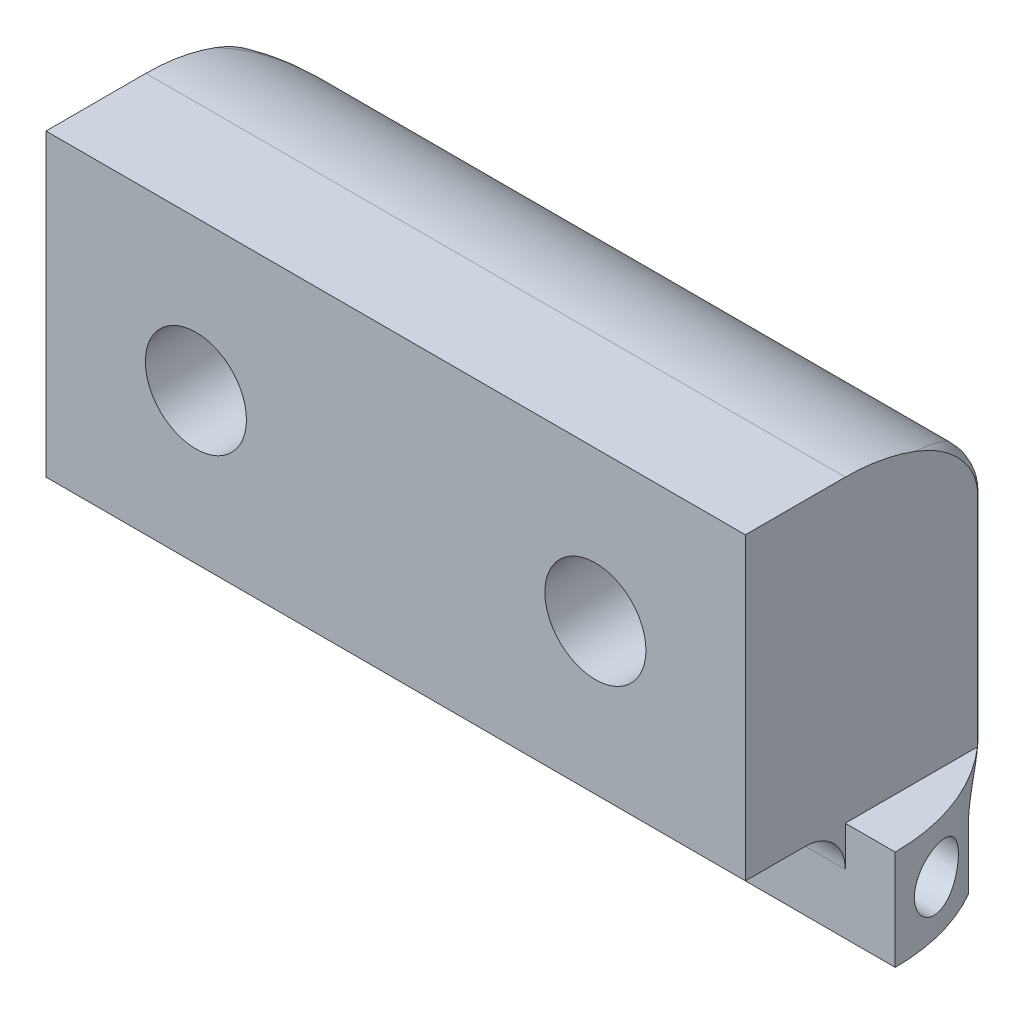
ISO-10303-21;
HEADER;
FILE_DESCRIPTION(('STEP AP214'),'2;1');
FILE_NAME('part.step','',(''),(''),'','','');
FILE_SCHEMA(('AUTOMOTIVE_DESIGN { 1 0 10303 214 1 1 1 1 }'));
ENDSEC;
DATA;
#1=APPLICATION_CONTEXT('core data for automotive mechanical design processes');
#2=APPLICATION_PROTOCOL_DEFINITION('international standard','automotive_design',2000,#1);
#3=PRODUCT_CONTEXT('',#1,'mechanical');
#4=PRODUCT('Part','Part','',(#3));
#5=PRODUCT_RELATED_PRODUCT_CATEGORY('part','',(#4));
#6=PRODUCT_DEFINITION_FORMATION('','',#4);
#7=PRODUCT_DEFINITION_CONTEXT('part definition',#1,'design');
#8=PRODUCT_DEFINITION('design','',#6,#7);
#9=PRODUCT_DEFINITION_SHAPE('','',#8);
#10=(LENGTH_UNIT() NAMED_UNIT(*) SI_UNIT(.MILLI.,.METRE.));
#11=(NAMED_UNIT(*) PLANE_ANGLE_UNIT() SI_UNIT($,.RADIAN.));
#12=(NAMED_UNIT(*) SI_UNIT($,.STERADIAN.) SOLID_ANGLE_UNIT());
#13=UNCERTAINTY_MEASURE_WITH_UNIT(LENGTH_MEASURE(1.E-05),#10,'distance_accuracy_value','');
#14=(GEOMETRIC_REPRESENTATION_CONTEXT(3) GLOBAL_UNCERTAINTY_ASSIGNED_CONTEXT((#13)) GLOBAL_UNIT_ASSIGNED_CONTEXT((#10,
#11,#12)) REPRESENTATION_CONTEXT('',''));
#15=CARTESIAN_POINT('',(0.,0.,0.));
#16=DIRECTION('',(0.,0.,1.));
#17=DIRECTION('',(1.,0.,0.));
#18=AXIS2_PLACEMENT_3D('',#15,#16,#17);
#19=CARTESIAN_POINT('',(12.7,0.,12.7));
#20=DIRECTION('',(0.,1.,0.));
#21=DIRECTION('',(0.,0.,1.));
#22=AXIS2_PLACEMENT_3D('',#19,#20,#21);
#23=CYLINDRICAL_SURFACE('',#22,12.7);
#24=CARTESIAN_POINT('',(12.7,0.,12.7));
#25=DIRECTION('',(0.,1.,0.));
#26=DIRECTION('',(0.,0.,1.));
#27=AXIS2_PLACEMENT_3D('',#24,#25,#26);
#28=CIRCLE('',#27,12.7);
#29=CARTESIAN_POINT('',(0.,0.,12.7));
#30=VERTEX_POINT('',#29);
#31=CARTESIAN_POINT('',(3.175,0.,4.29973958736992));
#32=VERTEX_POINT('',#31);
#33=EDGE_CURVE('E11',#30,#32,#28,.F.);
#34=ORIENTED_EDGE('',*,*,#33,.T.);
#35=DIRECTION('',(0.,1.,0.));
#36=VECTOR('',#35,1.);
#37=CARTESIAN_POINT('',(3.175,0.,4.29973958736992));
#38=LINE('',#37,#36);
#39=CARTESIAN_POINT('',(3.175,13.97,4.29973958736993));
#40=VERTEX_POINT('',#39);
#41=EDGE_CURVE('E386',#32,#40,#38,.T.);
#42=ORIENTED_EDGE('',*,*,#41,.T.);
#43=CARTESIAN_POINT('',(12.7,6.35,12.7));
#44=DIRECTION('',(-0.624695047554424,-0.78086880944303,0.));
#45=DIRECTION('',(0.78086880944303,-0.624695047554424,0.));
#46=AXIS2_PLACEMENT_3D('',#43,#44,#45);
#47=ELLIPSE('',#46,16.2639355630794,12.7);
#48=CARTESIAN_POINT('',(12.7,6.35,0.));
#49=VERTEX_POINT('',#48);
#50=EDGE_CURVE('E320',#49,#40,#47,.F.);
#51=ORIENTED_EDGE('',*,*,#50,.F.);
#52=DIRECTION('',(0.,-1.,0.));
#53=VECTOR('',#52,1.);
#54=CARTESIAN_POINT('',(12.7,16.51,0.));
#55=LINE('',#54,#53);
#56=CARTESIAN_POINT('',(12.7,0.,0.));
#57=VERTEX_POINT('',#56);
#58=EDGE_CURVE('E469',#57,#49,#55,.F.);
#59=ORIENTED_EDGE('',*,*,#58,.F.);
#60=CARTESIAN_POINT('',(12.7,0.,12.7));
#61=DIRECTION('',(0.,1.,0.));
#62=DIRECTION('',(0.,0.,1.));
#63=AXIS2_PLACEMENT_3D('',#60,#61,#62);
#64=CIRCLE('',#63,12.7);
#65=CARTESIAN_POINT('',(3.63038589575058,0.,3.81));
#66=VERTEX_POINT('',#65);
#67=EDGE_CURVE('E473',#66,#57,#64,.F.);
#68=ORIENTED_EDGE('',*,*,#67,.F.);
#69=CARTESIAN_POINT('',(1.70147737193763,-2.54,6.35));
#70=CARTESIAN_POINT('',(1.70147564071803,-2.4762854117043,6.35001052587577));
#71=CARTESIAN_POINT('',(1.70286146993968,-2.41257560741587,6.34760286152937));
#72=CARTESIAN_POINT('',(1.70839377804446,-2.28564858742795,6.33803108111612));
#73=CARTESIAN_POINT('',(1.7125396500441,-2.22243126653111,6.33086801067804));
#74=CARTESIAN_POINT('',(1.72355914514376,-2.09715343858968,6.31189702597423));
#75=CARTESIAN_POINT('',(1.73042360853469,-2.03508977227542,6.30010471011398));
#76=CARTESIAN_POINT('',(1.74684541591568,-1.91236401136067,6.2720401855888));
#77=CARTESIAN_POINT('',(1.75640280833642,-1.85170194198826,6.25576789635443));
#78=CARTESIAN_POINT('',(1.78905671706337,-1.67249655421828,6.20052554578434));
#79=CARTESIAN_POINT('',(1.81614879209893,-1.55657642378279,6.15510557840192));
#80=CARTESIAN_POINT('',(1.88048544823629,-1.3348861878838,6.04929232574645));
#81=CARTESIAN_POINT('',(1.917735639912,-1.22912173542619,5.98889076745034));
#82=CARTESIAN_POINT('',(2.00317212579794,-1.02638163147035,5.85350609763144));
#83=CARTESIAN_POINT('',(2.05169171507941,-0.929835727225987,5.77809139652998));
#84=CARTESIAN_POINT('',(2.15791832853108,-0.751287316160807,5.61736028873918));
#85=CARTESIAN_POINT('',(2.21562366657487,-0.669282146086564,5.53204570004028));
#86=CARTESIAN_POINT('',(2.34622921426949,-0.511779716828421,5.34446399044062));
#87=CARTESIAN_POINT('',(2.42011139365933,-0.438086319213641,5.24137265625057));
#88=CARTESIAN_POINT('',(2.57668341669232,-0.308837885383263,5.03020316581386));
#89=CARTESIAN_POINT('',(2.65939651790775,-0.253332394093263,4.9221122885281));
#90=CARTESIAN_POINT('',(2.81256486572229,-0.170213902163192,4.72878518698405));
#91=CARTESIAN_POINT('',(2.88159692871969,-0.139135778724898,4.64387241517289));
#92=CARTESIAN_POINT('',(3.02342986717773,-0.0867293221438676,4.47405094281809));
#93=CARTESIAN_POINT('',(3.09623430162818,-0.0654103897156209,4.38914232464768));
#94=CARTESIAN_POINT('',(3.24454607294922,-0.0319777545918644,4.22079669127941));
#95=CARTESIAN_POINT('',(3.32003560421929,-0.01981218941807,4.13735404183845));
#96=CARTESIAN_POINT('',(3.47346363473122,-0.00383561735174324,3.97224026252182));
#97=CARTESIAN_POINT('',(3.5513968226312,-7.61390269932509E-06,3.89056586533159));
#98=CARTESIAN_POINT('',(3.63038589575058,0.,3.81));
#99=B_SPLINE_CURVE_WITH_KNOTS('',3,(#69,#70,#71,#72,#73,#74,#75,#76,#77,#78,#79,#80,#81,#82,#83,
#84,#85,#86,#87,#88,#89,#90,#91,#92,#93,#94,#95,#96,#97,#98),.UNSPECIFIED.,.F.,.F.,(4,2,2,2,2,2,
2,2,2,2,2,2,2,2,4),(0.,0.191075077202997,0.382108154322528,0.572502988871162,0.762901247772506,
1.14322356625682,1.52375637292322,1.91743287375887,2.31103719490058,2.7494533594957,
3.18905405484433,3.52985298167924,3.87097950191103,4.21015835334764,4.54864512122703),.UNSPECIFIED.);
#100=CARTESIAN_POINT('',(1.70147737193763,-2.54,6.35));
#101=VERTEX_POINT('',#100);
#102=EDGE_CURVE('E299',#101,#66,#99,.T.);
#103=ORIENTED_EDGE('',*,*,#102,.F.);
#104=DIRECTION('',(0.,1.,0.));
#105=VECTOR('',#104,1.);
#106=CARTESIAN_POINT('',(1.70147737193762,-6.35,6.35));
#107=LINE('',#106,#105);
#108=CARTESIAN_POINT('',(1.70147737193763,-6.35,6.35));
#109=VERTEX_POINT('',#108);
#110=EDGE_CURVE('E60',#109,#101,#107,.T.);
#111=ORIENTED_EDGE('',*,*,#110,.F.);
#112=CARTESIAN_POINT('',(12.7,-6.35,12.7));
#113=DIRECTION('',(0.,-1.,0.));
#114=DIRECTION('',(0.,0.,-1.));
#115=AXIS2_PLACEMENT_3D('',#112,#113,#114);
#116=CIRCLE('',#115,12.7);
#117=CARTESIAN_POINT('',(0.,-6.35,12.7));
#118=VERTEX_POINT('',#117);
#119=EDGE_CURVE('E741',#118,#109,#116,.T.);
#120=ORIENTED_EDGE('',*,*,#119,.F.);
#121=DIRECTION('',(0.,1.,0.));
#122=VECTOR('',#121,1.);
#123=CARTESIAN_POINT('',(0.,0.,12.7));
#124=LINE('',#123,#122);
#125=EDGE_CURVE('E422',#118,#30,#124,.T.);
#126=ORIENTED_EDGE('',*,*,#125,.T.);
#127=EDGE_LOOP('',(#34,#42,#51,#59,#68,#103,#111,#120,#126));
#128=FACE_BOUND('',#127,.T.);
#129=CARTESIAN_POINT('',(1.05472324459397,-3.175,7.6327));
#130=CARTESIAN_POINT('',(1.05471992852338,-3.07449829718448,7.63270501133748));
#131=CARTESIAN_POINT('',(1.05121271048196,-2.9739341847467,7.64074418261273));
#132=CARTESIAN_POINT('',(1.0374428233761,-2.77574872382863,7.67257057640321));
#133=CARTESIAN_POINT('',(1.02717301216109,-2.67813060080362,7.69637444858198));
#134=CARTESIAN_POINT('',(1.00066661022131,-2.48886491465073,7.75867108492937));
#135=CARTESIAN_POINT('',(0.984445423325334,-2.39720265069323,7.79712593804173));
#136=CARTESIAN_POINT('',(0.947101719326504,-2.22180438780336,7.88733390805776));
#137=CARTESIAN_POINT('',(0.925979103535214,-2.13806854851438,7.93908729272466));
#138=CARTESIAN_POINT('',(0.87907094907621,-1.97691856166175,8.05674645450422));
#139=CARTESIAN_POINT('',(0.85312627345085,-1.89992020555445,8.12315722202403));
#140=CARTESIAN_POINT('',(0.798609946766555,-1.75793635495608,8.26685013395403));
#141=CARTESIAN_POINT('',(0.77003744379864,-1.69295477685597,8.34413580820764));
#142=CARTESIAN_POINT('',(0.709471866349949,-1.57204015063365,8.51360675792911));
#143=CARTESIAN_POINT('',(0.677380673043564,-1.51709658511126,8.60646438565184));
#144=CARTESIAN_POINT('',(0.6131655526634,-1.4237281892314,8.80014842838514));
#145=CARTESIAN_POINT('',(0.581041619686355,-1.38530722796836,8.90097670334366));
#146=CARTESIAN_POINT('',(0.517074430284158,-1.32514065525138,9.11130058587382));
#147=CARTESIAN_POINT('',(0.485270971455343,-1.30395079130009,9.22096822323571));
#148=CARTESIAN_POINT('',(0.424197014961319,-1.28118628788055,9.4430209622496));
#149=CARTESIAN_POINT('',(0.3949262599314,-1.27960965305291,9.55540578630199));
#150=CARTESIAN_POINT('',(0.340345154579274,-1.29636891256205,9.77737338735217));
#151=CARTESIAN_POINT('',(0.314969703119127,-1.31432410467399,9.88696861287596));
#152=CARTESIAN_POINT('',(0.268067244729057,-1.36942765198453,10.102084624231));
#153=CARTESIAN_POINT('',(0.246539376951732,-1.40657170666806,10.2076063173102));
#154=CARTESIAN_POINT('',(0.208275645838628,-1.49748987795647,10.4072332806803));
#155=CARTESIAN_POINT('',(0.19139015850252,-1.55058692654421,10.5016184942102));
#156=CARTESIAN_POINT('',(0.1612932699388,-1.6724369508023,10.6803330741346));
#157=CARTESIAN_POINT('',(0.148081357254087,-1.74118774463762,10.7646638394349));
#158=CARTESIAN_POINT('',(0.125319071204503,-1.89053470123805,10.9186176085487));
#159=CARTESIAN_POINT('',(0.11568699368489,-1.97079975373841,10.9885500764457));
#160=CARTESIAN_POINT('',(0.0992501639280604,-2.1421014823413,11.1140858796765));
#161=CARTESIAN_POINT('',(0.0924452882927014,-2.23313768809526,11.1696898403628));
#162=CARTESIAN_POINT('',(0.0812942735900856,-2.42270278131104,11.2645414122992));
#163=CARTESIAN_POINT('',(0.0769313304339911,-2.52117503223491,11.3039003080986));
#164=CARTESIAN_POINT('',(0.0702537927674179,-2.72336884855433,11.3656526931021));
#165=CARTESIAN_POINT('',(0.067939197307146,-2.82709041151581,11.3880461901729));
#166=CARTESIAN_POINT('',(0.0651467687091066,-3.03687298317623,11.4152144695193));
#167=CARTESIAN_POINT('',(0.0646695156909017,-3.14293472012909,11.4199836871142));
#168=CARTESIAN_POINT('',(0.0655065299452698,-3.35435935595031,11.4117489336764));
#169=CARTESIAN_POINT('',(0.0668208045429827,-3.45972225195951,11.3987448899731));
#170=CARTESIAN_POINT('',(0.0713682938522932,-3.66681671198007,11.355331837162));
#171=CARTESIAN_POINT('',(0.0746025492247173,-3.76854627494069,11.3249133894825));
#172=CARTESIAN_POINT('',(0.083267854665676,-3.9654197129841,11.2475623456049));
#173=CARTESIAN_POINT('',(0.0886988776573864,-4.06056366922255,11.2006299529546));
#174=CARTESIAN_POINT('',(0.102129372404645,-4.24149735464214,11.0916925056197));
#175=CARTESIAN_POINT('',(0.110127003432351,-4.32729372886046,11.0296982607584));
#176=CARTESIAN_POINT('',(0.129092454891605,-4.48719178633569,10.8924974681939));
#177=CARTESIAN_POINT('',(0.140060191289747,-4.56129380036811,10.8172912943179));
#178=CARTESIAN_POINT('',(0.165307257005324,-4.69578177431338,10.6559521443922));
#179=CARTESIAN_POINT('',(0.179586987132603,-4.75616607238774,10.5698178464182));
#180=CARTESIAN_POINT('',(0.211651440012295,-4.86165316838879,10.3892538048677));
#181=CARTESIAN_POINT('',(0.229436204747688,-4.9067557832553,10.2948239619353));
#182=CARTESIAN_POINT('',(0.268665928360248,-4.98098917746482,10.0996307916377));
#183=CARTESIAN_POINT('',(0.290141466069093,-5.00997718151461,9.9988193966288));
#184=CARTESIAN_POINT('',(0.336374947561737,-5.05090225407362,9.79453178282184));
#185=CARTESIAN_POINT('',(0.361133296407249,-5.06283721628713,9.69105523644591));
#186=CARTESIAN_POINT('',(0.414089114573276,-5.06977698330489,9.48155878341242));
#187=CARTESIAN_POINT('',(0.442359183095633,-5.06433419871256,9.37554259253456));
#188=CARTESIAN_POINT('',(0.500988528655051,-5.03601692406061,9.16645778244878));
#189=CARTESIAN_POINT('',(0.531348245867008,-5.01313875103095,9.06338979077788));
#190=CARTESIAN_POINT('',(0.594267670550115,-4.94958350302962,8.85902420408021));
#191=CARTESIAN_POINT('',(0.626867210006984,-4.90827750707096,8.75793419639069));
#192=CARTESIAN_POINT('',(0.691832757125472,-4.80889864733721,8.56425739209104));
#193=CARTESIAN_POINT('',(0.72419871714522,-4.75082245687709,8.47167228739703));
#194=CARTESIAN_POINT('',(0.78772575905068,-4.61802654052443,8.29583960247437));
#195=CARTESIAN_POINT('',(0.818853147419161,-4.54301682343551,8.21279818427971));
#196=CARTESIAN_POINT('',(0.877440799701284,-4.37872270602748,8.06062965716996));
#197=CARTESIAN_POINT('',(0.904900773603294,-4.28943717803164,7.99150364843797));
#198=CARTESIAN_POINT('',(0.953432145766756,-4.10206483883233,7.87172987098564));
#199=CARTESIAN_POINT('',(0.974686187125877,-4.00437126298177,7.82054235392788));
#200=CARTESIAN_POINT('',(1.01034960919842,-3.800584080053,7.73570575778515));
#201=CARTESIAN_POINT('',(1.02477131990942,-3.69450601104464,7.70202507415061));
#202=CARTESIAN_POINT('',(1.04161330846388,-3.51878039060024,7.66291069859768));
#203=CARTESIAN_POINT('',(1.04651193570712,-3.45061970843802,7.65160587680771));
#204=CARTESIAN_POINT('',(1.05306793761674,-3.31331582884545,7.63649905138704));
#205=CARTESIAN_POINT('',(1.05472552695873,-3.24417269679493,7.63269655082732));
#206=CARTESIAN_POINT('',(1.05472324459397,-3.175,7.6327));
#207=B_SPLINE_CURVE_WITH_KNOTS('',3,(#129,#130,#131,#132,#133,#134,#135,#136,#137,#138,#139,
#140,#141,#142,#143,#144,#145,#146,#147,#148,#149,#150,#151,#152,#153,#154,#155,#156,#157,#158,
#159,#160,#161,#162,#163,#164,#165,#166,#167,#168,#169,#170,#171,#172,#173,#174,#175,#176,#177,
#178,#179,#180,#181,#182,#183,#184,#185,#186,#187,#188,#189,#190,#191,#192,#193,#194,#195,#196,
#197,#198,#199,#200,#201,#202,#203,#204,#205,#206),.UNSPECIFIED.,.T.,.F.,(4,2,2,2,2,2,2,2,2,2,2,
2,2,2,2,2,2,2,2,2,2,2,2,2,2,2,2,2,2,2,2,2,2,2,2,2,2,2,4),(0.,0.301239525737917,
0.602797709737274,0.903580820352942,1.20436998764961,1.51785011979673,1.8314322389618,
2.16761141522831,2.50386927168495,2.85058444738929,3.19726434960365,3.5373061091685,
3.87727169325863,4.20446743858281,4.53161760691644,4.85076053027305,5.16988952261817,
5.48679455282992,5.80369943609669,6.12070437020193,6.43771060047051,6.75488881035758,
7.07206311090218,7.38901044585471,7.70594881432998,8.0229255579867,8.33990609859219,
8.6596520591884,8.97943750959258,9.30752530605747,9.6356824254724,9.97601563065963,
10.3164163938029,10.6631606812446,11.0099323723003,11.3451296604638,11.6797197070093,
11.8870687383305,12.0944040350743),.UNSPECIFIED.);
#208=CARTESIAN_POINT('',(1.05472324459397,-3.175,7.6327));
#209=VERTEX_POINT('',#208);
#210=EDGE_CURVE('E203',#209,#209,#207,.T.);
#211=ORIENTED_EDGE('',*,*,#210,.T.);
#212=EDGE_LOOP('',(#211));
#213=FACE_BOUND('',#212,.T.);
#214=ADVANCED_FACE('F35',(#128,#213),#23,.T.);
#215=CARTESIAN_POINT('',(38.1,0.,12.7));
#216=DIRECTION('',(0.,-1.,0.));
#217=DIRECTION('',(0.,0.,-1.));
#218=AXIS2_PLACEMENT_3D('',#215,#216,#217);
#219=CYLINDRICAL_SURFACE('',#218,12.7);
#220=CARTESIAN_POINT('',(38.1,6.35,12.7));
#221=DIRECTION('',(-0.624695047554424,0.78086880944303,0.));
#222=DIRECTION('',(-0.78086880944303,-0.624695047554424,0.));
#223=AXIS2_PLACEMENT_3D('',#220,#221,#222);
#224=ELLIPSE('',#223,16.2639355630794,12.7);
#225=CARTESIAN_POINT('',(38.1,6.35,0.));
#226=VERTEX_POINT('',#225);
#227=CARTESIAN_POINT('',(47.625,13.97,4.29973958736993));
#228=VERTEX_POINT('',#227);
#229=EDGE_CURVE('E309',#226,#228,#224,.F.);
#230=ORIENTED_EDGE('',*,*,#229,.T.);
#231=DIRECTION('',(0.,-1.,0.));
#232=VECTOR('',#231,1.);
#233=CARTESIAN_POINT('',(47.625,0.,4.29973958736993));
#234=LINE('',#233,#232);
#235=CARTESIAN_POINT('',(47.625,0.,4.29973958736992));
#236=VERTEX_POINT('',#235);
#237=EDGE_CURVE('E339',#228,#236,#234,.T.);
#238=ORIENTED_EDGE('',*,*,#237,.T.);
#239=CARTESIAN_POINT('',(38.1,0.,12.7));
#240=DIRECTION('',(0.,1.,0.));
#241=DIRECTION('',(0.,0.,1.));
#242=AXIS2_PLACEMENT_3D('',#239,#240,#241);
#243=CIRCLE('',#242,12.7);
#244=CARTESIAN_POINT('',(50.8,0.,12.7));
#245=VERTEX_POINT('',#244);
#246=EDGE_CURVE('E206',#236,#245,#243,.F.);
#247=ORIENTED_EDGE('',*,*,#246,.T.);
#248=DIRECTION('',(0.,1.,0.));
#249=VECTOR('',#248,1.);
#250=CARTESIAN_POINT('',(50.8,0.,12.7));
#251=LINE('',#250,#249);
#252=CARTESIAN_POINT('',(50.8,-6.35,12.7));
#253=VERTEX_POINT('',#252);
#254=EDGE_CURVE('E52',#253,#245,#251,.T.);
#255=ORIENTED_EDGE('',*,*,#254,.F.);
#256=CARTESIAN_POINT('',(38.1,-6.35,12.7));
#257=DIRECTION('',(0.,-1.,0.));
#258=DIRECTION('',(0.,0.,-1.));
#259=AXIS2_PLACEMENT_3D('',#256,#257,#258);
#260=CIRCLE('',#259,12.7);
#261=CARTESIAN_POINT('',(49.0985226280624,-6.35,6.35));
#262=VERTEX_POINT('',#261);
#263=EDGE_CURVE('E740',#262,#253,#260,.T.);
#264=ORIENTED_EDGE('',*,*,#263,.F.);
#265=DIRECTION('',(0.,-1.,0.));
#266=VECTOR('',#265,1.);
#267=CARTESIAN_POINT('',(49.0985226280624,-2.54,6.35));
#268=LINE('',#267,#266);
#269=CARTESIAN_POINT('',(49.0985226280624,-2.54,6.35));
#270=VERTEX_POINT('',#269);
#271=EDGE_CURVE('E482',#270,#262,#268,.T.);
#272=ORIENTED_EDGE('',*,*,#271,.F.);
#273=CARTESIAN_POINT('',(47.1696141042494,0.,3.81));
#274=CARTESIAN_POINT('',(47.2445279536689,-6.57358224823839E-06,3.88641242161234));
#275=CARTESIAN_POINT('',(47.3184896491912,-0.0034500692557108,3.96381530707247));
#276=CARTESIAN_POINT('',(47.4642155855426,-0.0177869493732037,4.1202075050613));
#277=CARTESIAN_POINT('',(47.5359761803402,-0.0286920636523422,4.1991991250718));
#278=CARTESIAN_POINT('',(47.6772882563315,-0.0586420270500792,4.35871738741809));
#279=CARTESIAN_POINT('',(47.7468194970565,-0.0777464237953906,4.43925105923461));
#280=CARTESIAN_POINT('',(47.882571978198,-0.124672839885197,4.60046939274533));
#281=CARTESIAN_POINT('',(47.948795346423,-0.152489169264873,4.68115392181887));
#282=CARTESIAN_POINT('',(48.1131144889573,-0.235400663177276,4.88635686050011));
#283=CARTESIAN_POINT('',(48.208573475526,-0.297073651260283,5.01042979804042));
#284=CARTESIAN_POINT('',(48.388009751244,-0.444400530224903,5.25221927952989));
#285=CARTESIAN_POINT('',(48.4720159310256,-0.52999235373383,5.36995134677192));
#286=CARTESIAN_POINT('',(48.588225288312,-0.67701873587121,5.53816358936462));
#287=CARTESIAN_POINT('',(48.6255059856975,-0.729475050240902,5.59311547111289));
#288=CARTESIAN_POINT('',(48.6963373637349,-0.840432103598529,5.69916559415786));
#289=CARTESIAN_POINT('',(48.7298899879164,-0.898929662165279,5.75026583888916));
#290=CARTESIAN_POINT('',(48.7930182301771,-1.02172714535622,5.84779280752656));
#291=CARTESIAN_POINT('',(48.8225925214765,-1.08602899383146,5.89421797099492));
#292=CARTESIAN_POINT('',(48.8775120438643,-1.21997676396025,5.98152590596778));
#293=CARTESIAN_POINT('',(48.9028582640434,-1.28962143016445,6.02240997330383));
#294=CARTESIAN_POINT('',(48.9457281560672,-1.42308874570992,6.09230691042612));
#295=CARTESIAN_POINT('',(48.9638538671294,-1.48626874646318,6.12218144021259));
#296=CARTESIAN_POINT('',(48.9967746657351,-1.61561436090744,6.17686264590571));
#297=CARTESIAN_POINT('',(49.0115703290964,-1.68177945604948,6.2016701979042));
#298=CARTESIAN_POINT('',(49.0377275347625,-1.81645282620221,6.24579403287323));
#299=CARTESIAN_POINT('',(49.0490945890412,-1.8849571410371,6.26511912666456));
#300=CARTESIAN_POINT('',(49.068359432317,-2.02377975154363,6.29801173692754));
#301=CARTESIAN_POINT('',(49.0762589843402,-2.09409710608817,6.31158217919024));
#302=CARTESIAN_POINT('',(49.0877750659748,-2.22694508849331,6.33141154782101));
#303=CARTESIAN_POINT('',(49.0918070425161,-2.28933525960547,6.33837831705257));
#304=CARTESIAN_POINT('',(49.0971796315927,-2.41448172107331,6.34767402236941));
#305=CARTESIAN_POINT('',(49.0985242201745,-2.47723733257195,6.3500098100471));
#306=CARTESIAN_POINT('',(49.0985226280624,-2.54,6.35));
#307=B_SPLINE_CURVE_WITH_KNOTS('',3,(#273,#274,#275,#276,#277,#278,#279,#280,#281,#282,#283,
#284,#285,#286,#287,#288,#289,#290,#291,#292,#293,#294,#295,#296,#297,#298,#299,#300,#301,#302,
#303,#304,#305,#306),.UNSPECIFIED.,.F.,.F.,(4,2,2,2,2,2,2,2,2,2,2,2,2,2,2,2,4),(0.,
0.321023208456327,0.642552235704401,0.96645698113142,1.29015061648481,1.79292915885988,
2.29441495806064,2.54796393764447,2.80138010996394,3.05488058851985,3.30832168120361,
3.52461901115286,3.74087891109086,3.95678926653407,4.17258971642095,4.36108619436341,
4.54930358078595),.UNSPECIFIED.);
#308=CARTESIAN_POINT('',(47.1696141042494,0.,3.81));
#309=VERTEX_POINT('',#308);
#310=EDGE_CURVE('E477',#309,#270,#307,.T.);
#311=ORIENTED_EDGE('',*,*,#310,.F.);
#312=CARTESIAN_POINT('',(38.1,0.,12.7));
#313=DIRECTION('',(0.,1.,0.));
#314=DIRECTION('',(0.,0.,1.));
#315=AXIS2_PLACEMENT_3D('',#312,#313,#314);
#316=CIRCLE('',#315,12.7);
#317=CARTESIAN_POINT('',(38.1,0.,0.));
#318=VERTEX_POINT('',#317);
#319=EDGE_CURVE('E475',#318,#309,#316,.F.);
#320=ORIENTED_EDGE('',*,*,#319,.F.);
#321=DIRECTION('',(0.,1.,0.));
#322=VECTOR('',#321,1.);
#323=CARTESIAN_POINT('',(38.1,0.,0.));
#324=LINE('',#323,#322);
#325=EDGE_CURVE('E471',#226,#318,#324,.F.);
#326=ORIENTED_EDGE('',*,*,#325,.F.);
#327=EDGE_LOOP('',(#230,#238,#247,#255,#264,#272,#311,#320,#326));
#328=FACE_BOUND('',#327,.T.);
#329=CARTESIAN_POINT('',(49.745276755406,-3.175,7.6327));
#330=CARTESIAN_POINT('',(49.7452800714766,-3.27550170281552,7.63270501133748));
#331=CARTESIAN_POINT('',(49.748787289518,-3.3760658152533,7.64074418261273));
#332=CARTESIAN_POINT('',(49.7625571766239,-3.57425127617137,7.67257057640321));
#333=CARTESIAN_POINT('',(49.7728269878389,-3.67186939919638,7.69637444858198));
#334=CARTESIAN_POINT('',(49.7993333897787,-3.86113508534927,7.75867108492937));
#335=CARTESIAN_POINT('',(49.8155545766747,-3.95279734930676,7.79712593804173));
#336=CARTESIAN_POINT('',(49.8528982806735,-4.12819561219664,7.88733390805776));
#337=CARTESIAN_POINT('',(49.8740208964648,-4.21193145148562,7.93908729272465));
#338=CARTESIAN_POINT('',(49.9209290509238,-4.37308143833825,8.05674645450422));
#339=CARTESIAN_POINT('',(49.9468737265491,-4.45007979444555,8.12315722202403));
#340=CARTESIAN_POINT('',(50.0013900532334,-4.59206364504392,8.26685013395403));
#341=CARTESIAN_POINT('',(50.0299625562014,-4.65704522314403,8.34413580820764));
#342=CARTESIAN_POINT('',(50.0905281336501,-4.77795984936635,8.51360675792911));
#343=CARTESIAN_POINT('',(50.1226193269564,-4.83290341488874,8.60646438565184));
#344=CARTESIAN_POINT('',(50.1868344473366,-4.9262718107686,8.80014842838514));
#345=CARTESIAN_POINT('',(50.2189583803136,-4.96469277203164,8.90097670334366));
#346=CARTESIAN_POINT('',(50.2829255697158,-5.02485934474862,9.11130058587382));
#347=CARTESIAN_POINT('',(50.3147290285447,-5.04604920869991,9.22096822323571));
#348=CARTESIAN_POINT('',(50.3758029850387,-5.06881371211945,9.4430209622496));
#349=CARTESIAN_POINT('',(50.4050737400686,-5.07039034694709,9.55540578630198));
#350=CARTESIAN_POINT('',(50.4596548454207,-5.05363108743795,9.77737338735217));
#351=CARTESIAN_POINT('',(50.4850302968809,-5.03567589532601,9.88696861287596));
#352=CARTESIAN_POINT('',(50.5319327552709,-4.98057234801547,10.102084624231));
#353=CARTESIAN_POINT('',(50.5534606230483,-4.94342829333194,10.2076063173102));
#354=CARTESIAN_POINT('',(50.5917243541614,-4.85251012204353,10.4072332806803));
#355=CARTESIAN_POINT('',(50.6086098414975,-4.79941307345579,10.5016184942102));
#356=CARTESIAN_POINT('',(50.6387067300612,-4.6775630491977,10.6803330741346));
#357=CARTESIAN_POINT('',(50.6519186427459,-4.60881225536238,10.7646638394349));
#358=CARTESIAN_POINT('',(50.6746809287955,-4.45946529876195,10.9186176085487));
#359=CARTESIAN_POINT('',(50.6843130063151,-4.37920024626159,10.9885500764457));
#360=CARTESIAN_POINT('',(50.7007498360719,-4.2078985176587,11.1140858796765));
#361=CARTESIAN_POINT('',(50.7075547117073,-4.11686231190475,11.1696898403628));
#362=CARTESIAN_POINT('',(50.7187057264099,-3.92729721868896,11.2645414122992));
#363=CARTESIAN_POINT('',(50.723068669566,-3.8288249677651,11.3039003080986));
#364=CARTESIAN_POINT('',(50.7297462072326,-3.62663115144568,11.3656526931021));
#365=CARTESIAN_POINT('',(50.7320608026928,-3.52290958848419,11.3880461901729));
#366=CARTESIAN_POINT('',(50.7348532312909,-3.31312701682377,11.4152144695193));
#367=CARTESIAN_POINT('',(50.7353304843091,-3.20706527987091,11.4199836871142));
#368=CARTESIAN_POINT('',(50.7344934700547,-2.99564064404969,11.4117489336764));
#369=CARTESIAN_POINT('',(50.733179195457,-2.89027774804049,11.3987448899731));
#370=CARTESIAN_POINT('',(50.7286317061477,-2.68318328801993,11.355331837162));
#371=CARTESIAN_POINT('',(50.7253974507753,-2.58145372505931,11.3249133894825));
#372=CARTESIAN_POINT('',(50.7167321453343,-2.3845802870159,11.2475623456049));
#373=CARTESIAN_POINT('',(50.7113011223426,-2.28943633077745,11.2006299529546));
#374=CARTESIAN_POINT('',(50.6978706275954,-2.10850264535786,11.0916925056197));
#375=CARTESIAN_POINT('',(50.6898729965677,-2.02270627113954,11.0296982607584));
#376=CARTESIAN_POINT('',(50.6709075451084,-1.86280821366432,10.8924974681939));
#377=CARTESIAN_POINT('',(50.6599398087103,-1.78870619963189,10.8172912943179));
#378=CARTESIAN_POINT('',(50.6346927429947,-1.65421822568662,10.6559521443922));
#379=CARTESIAN_POINT('',(50.6204130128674,-1.59383392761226,10.5698178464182));
#380=CARTESIAN_POINT('',(50.5883485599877,-1.48834683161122,10.3892538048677));
#381=CARTESIAN_POINT('',(50.5705637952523,-1.4432442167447,10.2948239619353));
#382=CARTESIAN_POINT('',(50.5313340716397,-1.36901082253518,10.0996307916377));
#383=CARTESIAN_POINT('',(50.5098585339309,-1.34002281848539,9.9988193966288));
#384=CARTESIAN_POINT('',(50.4636250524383,-1.29909774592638,9.79453178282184));
#385=CARTESIAN_POINT('',(50.4388667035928,-1.28716278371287,9.69105523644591));
#386=CARTESIAN_POINT('',(50.3859108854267,-1.28022301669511,9.48155878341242));
#387=CARTESIAN_POINT('',(50.3576408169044,-1.28566580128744,9.37554259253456));
#388=CARTESIAN_POINT('',(50.2990114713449,-1.31398307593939,9.16645778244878));
#389=CARTESIAN_POINT('',(50.268651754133,-1.33686124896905,9.06338979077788));
#390=CARTESIAN_POINT('',(50.2057323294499,-1.40041649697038,8.8590242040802));
#391=CARTESIAN_POINT('',(50.173132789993,-1.44172249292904,8.75793419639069));
#392=CARTESIAN_POINT('',(50.1081672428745,-1.54110135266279,8.56425739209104));
#393=CARTESIAN_POINT('',(50.0758012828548,-1.59917754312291,8.47167228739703));
#394=CARTESIAN_POINT('',(50.0122742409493,-1.73197345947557,8.29583960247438));
#395=CARTESIAN_POINT('',(49.9811468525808,-1.80698317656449,8.21279818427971));
#396=CARTESIAN_POINT('',(49.9225592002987,-1.97127729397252,8.06062965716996));
#397=CARTESIAN_POINT('',(49.8950992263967,-2.06056282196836,7.99150364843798));
#398=CARTESIAN_POINT('',(49.8465678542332,-2.24793516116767,7.87172987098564));
#399=CARTESIAN_POINT('',(49.8253138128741,-2.34562873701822,7.82054235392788));
#400=CARTESIAN_POINT('',(49.7896503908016,-2.549415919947,7.73570575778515));
#401=CARTESIAN_POINT('',(49.7752286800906,-2.65549398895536,7.70202507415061));
#402=CARTESIAN_POINT('',(49.7583866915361,-2.83121960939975,7.66291069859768));
#403=CARTESIAN_POINT('',(49.7534880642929,-2.89938029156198,7.65160587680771));
#404=CARTESIAN_POINT('',(49.7469320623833,-3.03668417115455,7.63649905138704));
#405=CARTESIAN_POINT('',(49.7452744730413,-3.10582730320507,7.63269655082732));
#406=CARTESIAN_POINT('',(49.745276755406,-3.175,7.6327));
#407=B_SPLINE_CURVE_WITH_KNOTS('',3,(#329,#330,#331,#332,#333,#334,#335,#336,#337,#338,#339,
#340,#341,#342,#343,#344,#345,#346,#347,#348,#349,#350,#351,#352,#353,#354,#355,#356,#357,#358,
#359,#360,#361,#362,#363,#364,#365,#366,#367,#368,#369,#370,#371,#372,#373,#374,#375,#376,#377,
#378,#379,#380,#381,#382,#383,#384,#385,#386,#387,#388,#389,#390,#391,#392,#393,#394,#395,#396,
#397,#398,#399,#400,#401,#402,#403,#404,#405,#406),.UNSPECIFIED.,.T.,.F.,(4,2,2,2,2,2,2,2,2,2,2,
2,2,2,2,2,2,2,2,2,2,2,2,2,2,2,2,2,2,2,2,2,2,2,2,2,2,2,4),(0.,0.301239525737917,
0.602797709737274,0.90358082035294,1.20436998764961,1.51785011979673,1.8314322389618,
2.16761141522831,2.50386927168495,2.85058444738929,3.19726434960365,3.5373061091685,
3.87727169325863,4.20446743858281,4.53161760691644,4.85076053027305,5.16988952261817,
5.48679455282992,5.80369943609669,6.12070437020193,6.43771060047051,6.75488881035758,
7.07206311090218,7.38901044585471,7.70594881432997,8.0229255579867,8.33990609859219,
8.6596520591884,8.97943750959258,9.30752530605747,9.6356824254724,9.97601563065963,
10.3164163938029,10.6631606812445,11.0099323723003,11.3451296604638,11.6797197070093,
11.8870687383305,12.0944040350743),.UNSPECIFIED.);
#408=CARTESIAN_POINT('',(49.745276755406,-3.175,7.6327));
#409=VERTEX_POINT('',#408);
#410=EDGE_CURVE('E359',#409,#409,#407,.T.);
#411=ORIENTED_EDGE('',*,*,#410,.T.);
#412=EDGE_LOOP('',(#411));
#413=FACE_BOUND('',#412,.T.);
#414=ADVANCED_FACE('F285',(#328,#413),#219,.T.);
#415=CARTESIAN_POINT('',(0.,0.,19.05));
#416=DIRECTION('',(0.,1.,0.));
#417=DIRECTION('',(0.,0.,1.));
#418=AXIS2_PLACEMENT_3D('',#415,#416,#417);
#419=PLANE('',#418);
#420=DIRECTION('',(0.,0.,-1.));
#421=VECTOR('',#420,1.);
#422=CARTESIAN_POINT('',(3.175,0.,29.464));
#423=LINE('',#422,#421);
#424=CARTESIAN_POINT('',(3.175,0.,19.05));
#425=VERTEX_POINT('',#424);
#426=CARTESIAN_POINT('',(3.175,0.,15.24));
#427=VERTEX_POINT('',#426);
#428=EDGE_CURVE('E385',#425,#427,#423,.T.);
#429=ORIENTED_EDGE('',*,*,#428,.T.);
#430=DIRECTION('',(-1.,0.,0.));
#431=VECTOR('',#430,1.);
#432=CARTESIAN_POINT('',(0.,0.,15.24));
#433=LINE('',#432,#431);
#434=CARTESIAN_POINT('',(10.16,0.,15.24));
#435=VERTEX_POINT('',#434);
#436=EDGE_CURVE('E445',#427,#435,#433,.F.);
#437=ORIENTED_EDGE('',*,*,#436,.T.);
#438=DIRECTION('',(0.,0.,-1.));
#439=VECTOR('',#438,1.);
#440=CARTESIAN_POINT('',(10.16,0.,102.108));
#441=LINE('',#440,#439);
#442=CARTESIAN_POINT('',(10.16,0.,3.81000000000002));
#443=VERTEX_POINT('',#442);
#444=EDGE_CURVE('E412',#435,#443,#441,.T.);
#445=ORIENTED_EDGE('',*,*,#444,.T.);
#446=DIRECTION('',(-1.,0.,0.));
#447=VECTOR('',#446,1.);
#448=CARTESIAN_POINT('',(0.,0.,3.81));
#449=LINE('',#448,#447);
#450=EDGE_CURVE('E449',#443,#66,#449,.T.);
#451=ORIENTED_EDGE('',*,*,#450,.T.);
#452=ORIENTED_EDGE('',*,*,#67,.T.);
#453=DIRECTION('',(1.,0.,0.));
#454=VECTOR('',#453,1.);
#455=CARTESIAN_POINT('',(0.,0.,0.));
#456=LINE('',#455,#454);
#457=EDGE_CURVE('E428',#57,#318,#456,.T.);
#458=ORIENTED_EDGE('',*,*,#457,.T.);
#459=ORIENTED_EDGE('',*,*,#319,.T.);
#460=DIRECTION('',(-1.,0.,0.));
#461=VECTOR('',#460,1.);
#462=CARTESIAN_POINT('',(0.,0.,3.81));
#463=LINE('',#462,#461);
#464=CARTESIAN_POINT('',(40.64,0.,3.81000000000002));
#465=VERTEX_POINT('',#464);
#466=EDGE_CURVE('E447',#309,#465,#463,.T.);
#467=ORIENTED_EDGE('',*,*,#466,.T.);
#468=DIRECTION('',(0.,0.,-1.));
#469=VECTOR('',#468,1.);
#470=CARTESIAN_POINT('',(40.64,0.,102.108));
#471=LINE('',#470,#469);
#472=CARTESIAN_POINT('',(40.64,0.,15.24));
#473=VERTEX_POINT('',#472);
#474=EDGE_CURVE('E408',#473,#465,#471,.T.);
#475=ORIENTED_EDGE('',*,*,#474,.F.);
#476=DIRECTION('',(-1.,0.,0.));
#477=VECTOR('',#476,1.);
#478=CARTESIAN_POINT('',(0.,0.,15.24));
#479=LINE('',#478,#477);
#480=CARTESIAN_POINT('',(47.625,0.,15.24));
#481=VERTEX_POINT('',#480);
#482=EDGE_CURVE('E439',#473,#481,#479,.F.);
#483=ORIENTED_EDGE('',*,*,#482,.T.);
#484=DIRECTION('',(0.,0.,-1.));
#485=VECTOR('',#484,1.);
#486=CARTESIAN_POINT('',(47.625,0.,29.464));
#487=LINE('',#486,#485);
#488=CARTESIAN_POINT('',(47.625,0.,19.05));
#489=VERTEX_POINT('',#488);
#490=EDGE_CURVE('E207',#489,#481,#487,.T.);
#491=ORIENTED_EDGE('',*,*,#490,.F.);
#492=DIRECTION('',(1.,0.,0.));
#493=VECTOR('',#492,1.);
#494=CARTESIAN_POINT('',(0.,0.,19.05));
#495=LINE('',#494,#493);
#496=EDGE_CURVE('E432',#425,#489,#495,.T.);
#497=ORIENTED_EDGE('',*,*,#496,.F.);
#498=EDGE_LOOP('',(#429,#437,#445,#451,#452,#458,#459,#467,#475,#483,#491,#497));
#499=FACE_BOUND('',#498,.T.);
#500=ADVANCED_FACE('F274',(#499),#419,.F.);
#501=CARTESIAN_POINT('',(0.,0.,19.05));
#502=DIRECTION('',(0.,0.,-1.));
#503=DIRECTION('',(-1.,0.,0.));
#504=AXIS2_PLACEMENT_3D('',#501,#502,#503);
#505=PLANE('',#504);
#506=DIRECTION('',(-1.,0.,0.));
#507=VECTOR('',#506,1.);
#508=CARTESIAN_POINT('',(0.,19.05,19.05));
#509=LINE('',#508,#507);
#510=CARTESIAN_POINT('',(47.625,19.05,19.05));
#511=VERTEX_POINT('',#510);
#512=CARTESIAN_POINT('',(3.175,19.05,19.05));
#513=VERTEX_POINT('',#512);
#514=EDGE_CURVE('E398',#511,#513,#509,.T.);
#515=ORIENTED_EDGE('',*,*,#514,.T.);
#516=DIRECTION('',(0.,1.,0.));
#517=VECTOR('',#516,1.);
#518=CARTESIAN_POINT('',(3.175,0.,19.05));
#519=LINE('',#518,#517);
#520=EDGE_CURVE('E208',#425,#513,#519,.T.);
#521=ORIENTED_EDGE('',*,*,#520,.F.);
#522=ORIENTED_EDGE('',*,*,#496,.T.);
#523=DIRECTION('',(0.,-1.,0.));
#524=VECTOR('',#523,1.);
#525=CARTESIAN_POINT('',(47.625,0.,19.05));
#526=LINE('',#525,#524);
#527=EDGE_CURVE('E313',#511,#489,#526,.T.);
#528=ORIENTED_EDGE('',*,*,#527,.F.);
#529=EDGE_LOOP('',(#515,#521,#522,#528));
#530=FACE_BOUND('',#529,.T.);
#531=CARTESIAN_POINT('',(12.7,9.525,19.05));
#532=DIRECTION('',(0.,0.,1.));
#533=DIRECTION('',(1.,0.,0.));
#534=AXIS2_PLACEMENT_3D('',#531,#532,#533);
#535=CIRCLE('',#534,3.2131);
#536=CARTESIAN_POINT('',(15.9131,9.525,19.05));
#537=VERTEX_POINT('',#536);
#538=EDGE_CURVE('E515',#537,#537,#535,.T.);
#539=ORIENTED_EDGE('',*,*,#538,.F.);
#540=EDGE_LOOP('',(#539));
#541=FACE_BOUND('',#540,.T.);
#542=CARTESIAN_POINT('',(38.0931002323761,9.525,19.05));
#543=DIRECTION('',(0.,0.,1.));
#544=DIRECTION('',(1.,0.,0.));
#545=AXIS2_PLACEMENT_3D('',#542,#543,#544);
#546=CIRCLE('',#545,3.2131);
#547=CARTESIAN_POINT('',(41.3062002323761,9.525,19.05));
#548=VERTEX_POINT('',#547);
#549=EDGE_CURVE('E522',#548,#548,#546,.T.);
#550=ORIENTED_EDGE('',*,*,#549,.F.);
#551=EDGE_LOOP('',(#550));
#552=FACE_BOUND('',#551,.T.);
#553=ADVANCED_FACE('F270',(#530,#541,#552),#505,.F.);
#554=CARTESIAN_POINT('',(0.,6.35,12.7));
#555=DIRECTION('',(1.,0.,0.));
#556=DIRECTION('',(0.,0.,-1.));
#557=AXIS2_PLACEMENT_3D('',#554,#555,#556);
#558=CYLINDRICAL_SURFACE('',#557,12.7);
#559=CARTESIAN_POINT('',(3.175,6.35,12.7));
#560=DIRECTION('',(-1.,0.,0.));
#561=DIRECTION('',(0.,0.,1.));
#562=AXIS2_PLACEMENT_3D('',#559,#560,#561);
#563=CIRCLE('',#562,12.7);
#564=CARTESIAN_POINT('',(3.175,18.25625,8.28058703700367));
#565=VERTEX_POINT('',#564);
#566=CARTESIAN_POINT('',(3.175,19.05,12.7));
#567=VERTEX_POINT('',#566);
#568=EDGE_CURVE('E211',#565,#567,#563,.F.);
#569=ORIENTED_EDGE('',*,*,#568,.T.);
#570=DIRECTION('',(-1.,0.,0.));
#571=VECTOR('',#570,1.);
#572=CARTESIAN_POINT('',(2.54,19.05,12.7));
#573=LINE('',#572,#571);
#574=CARTESIAN_POINT('',(47.625,19.05,12.7));
#575=VERTEX_POINT('',#574);
#576=EDGE_CURVE('E305',#575,#567,#573,.T.);
#577=ORIENTED_EDGE('',*,*,#576,.F.);
#578=CARTESIAN_POINT('',(47.625,6.35,12.7));
#579=DIRECTION('',(1.,0.,0.));
#580=DIRECTION('',(0.,0.,-1.));
#581=AXIS2_PLACEMENT_3D('',#578,#579,#580);
#582=CIRCLE('',#581,12.7);
#583=CARTESIAN_POINT('',(47.625,18.25625,8.28058703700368));
#584=VERTEX_POINT('',#583);
#585=EDGE_CURVE('E222',#575,#584,#582,.F.);
#586=ORIENTED_EDGE('',*,*,#585,.T.);
#587=CARTESIAN_POINT('',(38.1,6.35,12.7));
#588=DIRECTION('',(-0.78086880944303,0.624695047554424,0.));
#589=DIRECTION('',(-0.624695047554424,-0.78086880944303,0.));
#590=AXIS2_PLACEMENT_3D('',#587,#588,#589);
#591=ELLIPSE('',#590,16.2639355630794,12.7);
#592=EDGE_CURVE('E312',#226,#584,#591,.F.);
#593=ORIENTED_EDGE('',*,*,#592,.F.);
#594=DIRECTION('',(-1.,0.,0.));
#595=VECTOR('',#594,1.);
#596=CARTESIAN_POINT('',(48.26,6.35,0.));
#597=LINE('',#596,#595);
#598=EDGE_CURVE('E467',#49,#226,#597,.F.);
#599=ORIENTED_EDGE('',*,*,#598,.F.);
#600=CARTESIAN_POINT('',(12.7,6.35,12.7));
#601=DIRECTION('',(-0.78086880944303,-0.624695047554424,0.));
#602=DIRECTION('',(0.624695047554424,-0.78086880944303,0.));
#603=AXIS2_PLACEMENT_3D('',#600,#601,#602);
#604=ELLIPSE('',#603,16.2639355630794,12.7);
#605=EDGE_CURVE('E315',#49,#565,#604,.F.);
#606=ORIENTED_EDGE('',*,*,#605,.T.);
#607=EDGE_LOOP('',(#569,#577,#586,#593,#599,#606));
#608=FACE_BOUND('',#607,.T.);
#609=ADVANCED_FACE('F273',(#608),#558,.T.);
#610=CARTESIAN_POINT('',(12.7,6.35,0.));
#611=CARTESIAN_POINT('',(12.7,6.35,0.));
#612=CARTESIAN_POINT('',(12.7,6.35,0.));
#613=CARTESIAN_POINT('',(12.4233084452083,6.5713532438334,1.59353944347E-05));
#614=CARTESIAN_POINT('',(12.450977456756,6.59902254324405,-5.79497046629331E-06));
#615=CARTESIAN_POINT('',(12.4786467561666,6.62669155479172,1.59353944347E-05));
#616=CARTESIAN_POINT('',(12.146656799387,6.79267456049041,0.00904205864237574));
#617=CARTESIAN_POINT('',(12.2018145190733,6.84818548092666,0.00723850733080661));
#618=CARTESIAN_POINT('',(12.2573254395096,6.90334320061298,0.00904205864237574));
#619=CARTESIAN_POINT('',(11.5939244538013,7.23486043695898,0.0452220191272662));
#620=CARTESIAN_POINT('',(11.7039991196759,7.34600088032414,0.03620500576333));
#621=CARTESIAN_POINT('',(11.815139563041,7.45607554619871,0.0452220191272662));
#622=CARTESIAN_POINT('',(11.3178438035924,7.45572495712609,0.0723773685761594));
#623=CARTESIAN_POINT('',(11.4549924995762,7.59500750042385,0.0579697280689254));
#624=CARTESIAN_POINT('',(11.5942750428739,7.7321561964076,0.0723773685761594));
#625=CARTESIAN_POINT('',(10.4961180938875,8.11310552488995,0.180557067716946));
#626=CARTESIAN_POINT('',(10.7122708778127,8.33772912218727,0.14483672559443));
#627=CARTESIAN_POINT('',(10.93689447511,8.55388190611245,0.180557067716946));
#628=CARTESIAN_POINT('',(9.95209677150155,8.54832258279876,0.288294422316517));
#629=CARTESIAN_POINT('',(10.2184525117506,8.83154748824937,0.231788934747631));
#630=CARTESIAN_POINT('',(10.5016774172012,9.09790322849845,0.288294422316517));
#631=CARTESIAN_POINT('',(8.8829417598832,9.40364659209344,0.574766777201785));
#632=CARTESIAN_POINT('',(9.24490956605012,9.80509043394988,0.46299709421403));
#633=CARTESIAN_POINT('',(9.64635340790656,10.1670582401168,0.574766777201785));
#634=CARTESIAN_POINT('',(8.35764431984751,9.82388454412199,0.752280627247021));
#635=CARTESIAN_POINT('',(8.76239691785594,10.2876030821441,0.607574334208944));
#636=CARTESIAN_POINT('',(9.22611545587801,10.6923556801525,0.752280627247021));
#637=CARTESIAN_POINT('',(7.3349503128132,10.6420397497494,1.17589641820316));
#638=CARTESIAN_POINT('',(7.81659578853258,11.2334042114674,0.953634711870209));
#639=CARTESIAN_POINT('',(8.40796025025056,11.7150496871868,1.17589641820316));
#640=CARTESIAN_POINT('',(6.83718520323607,11.0402518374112,1.42020100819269));
#641=CARTESIAN_POINT('',(7.35061296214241,11.6993870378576,1.15557551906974));
#642=CARTESIAN_POINT('',(8.00974816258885,12.2128147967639,1.42020100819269));
#643=CARTESIAN_POINT('',(5.87832193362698,11.8073424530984,1.97380069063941));
#644=CARTESIAN_POINT('',(6.44285040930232,12.6071495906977,1.61640878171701));
#645=CARTESIAN_POINT('',(7.2426575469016,13.171678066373,1.97380069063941));
#646=CARTESIAN_POINT('',(5.41656097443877,12.1767512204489,2.28077961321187));
#647=CARTESIAN_POINT('',(5.99855140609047,13.0514485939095,1.87584095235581));
#648=CARTESIAN_POINT('',(6.87324877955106,13.6334390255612,2.28077961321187));
#649=CARTESIAN_POINT('',(4.53791341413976,12.8796692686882,2.95498971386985));
#650=CARTESIAN_POINT('',(5.1390241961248,13.9109758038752,2.45263615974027));
#651=CARTESIAN_POINT('',(6.17033073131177,14.5120865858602,2.95498971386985));
#652=CARTESIAN_POINT('',(4.11998843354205,13.2140092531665,3.31948856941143));
#653=CARTESIAN_POINT('',(4.72157350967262,14.3284264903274,2.77050407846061));
#654=CARTESIAN_POINT('',(5.8359907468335,14.9300115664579,3.31948856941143));
#655=CARTESIAN_POINT('',(3.3365505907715,13.8407595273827,4.10294746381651));
#656=CARTESIAN_POINT('',(3.9210700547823,15.1289299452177,3.46658295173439));
#657=CARTESIAN_POINT('',(5.20924047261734,15.7134494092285,4.10294746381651));
#658=CARTESIAN_POINT('',(2.96956337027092,14.1343493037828,4.5189257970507));
#659=CARTESIAN_POINT('',(3.5362479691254,15.5137520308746,3.84504477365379));
#660=CARTESIAN_POINT('',(4.91565069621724,16.0804366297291,4.5189257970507));
#661=CARTESIAN_POINT('',(2.29477564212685,14.674179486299,5.39831609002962));
#662=CARTESIAN_POINT('',(2.8078531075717,16.2421468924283,4.6660013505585));
#663=CARTESIAN_POINT('',(4.375820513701,16.7552243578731,5.39831609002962));
#664=CARTESIAN_POINT('',(1.98505624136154,14.9219550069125,5.85875558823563));
#665=CARTESIAN_POINT('',(2.46313224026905,16.5868677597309,5.10813022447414));
#666=CARTESIAN_POINT('',(4.12804499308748,17.0649437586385,5.85875558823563));
#667=CARTESIAN_POINT('',(1.43042251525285,15.365661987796,6.81954903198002));
#668=CARTESIAN_POINT('',(1.82446849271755,17.2255315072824,6.06076350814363));
#669=CARTESIAN_POINT('',(3.68433801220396,17.6195774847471,6.81954903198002));
#670=CARTESIAN_POINT('',(1.18325022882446,15.5633998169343,7.3172421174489));
#671=CARTESIAN_POINT('',(1.53010545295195,17.5198945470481,6.56977667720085));
#672=CARTESIAN_POINT('',(3.48660018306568,17.8667497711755,7.3172421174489));
#673=CARTESIAN_POINT('',(0.862615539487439,15.819907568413,8.09125175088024));
#674=CARTESIAN_POINT('',(1.13713481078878,17.9128651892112,7.38438082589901));
#675=CARTESIAN_POINT('',(3.23009243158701,18.1873844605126,8.09125175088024));
#676=CARTESIAN_POINT('',(0.76558847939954,15.8975292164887,8.34836015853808));
#677=CARTESIAN_POINT('',(1.01538818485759,18.0346118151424,7.66113720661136));
#678=CARTESIAN_POINT('',(3.15247078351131,18.2844115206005,8.34836015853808));
#679=CARTESIAN_POINT('',(0.587125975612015,16.040299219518,8.87312787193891));
#680=CARTESIAN_POINT('',(0.787742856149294,18.2622571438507,8.23541757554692));
#681=CARTESIAN_POINT('',(3.00970078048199,18.462874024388,8.87312787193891));
#682=CARTESIAN_POINT('',(0.505682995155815,16.1054536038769,9.14078200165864));
#683=CARTESIAN_POINT('',(0.682214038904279,18.3677859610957,8.53271921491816));
#684=CARTESIAN_POINT('',(2.9445463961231,18.5443170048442,9.14078200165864));
#685=CARTESIAN_POINT('',(0.361964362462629,16.2204285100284,9.67714063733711));
#686=CARTESIAN_POINT('',(0.493210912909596,18.5567890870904,9.13756011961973));
#687=CARTESIAN_POINT('',(2.82957148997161,18.6880356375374,9.67714063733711));
#688=CARTESIAN_POINT('',(0.299191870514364,16.2706465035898,9.94557854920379));
#689=CARTESIAN_POINT('',(0.409520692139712,18.6404793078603,9.44421722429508));
#690=CARTESIAN_POINT('',(2.77935349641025,18.7508081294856,9.94557854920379));
#691=CARTESIAN_POINT('',(0.190814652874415,16.3573482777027,10.489320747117));
#692=CARTESIAN_POINT('',(0.263257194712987,18.786742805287,10.0732929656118));
#693=CARTESIAN_POINT('',(2.69265172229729,18.8591853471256,10.489320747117));
#694=CARTESIAN_POINT('',(0.14520915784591,16.3938326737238,10.7646247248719));
#695=CARTESIAN_POINT('',(0.201027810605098,18.8489721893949,10.3950933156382));
#696=CARTESIAN_POINT('',(2.65616732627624,18.9047908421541,10.7646247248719));
#697=CARTESIAN_POINT('',(0.0726876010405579,16.4518499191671,11.3154811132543));
#698=CARTESIAN_POINT('',(0.101186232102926,18.9488137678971,11.0451482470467));
#699=CARTESIAN_POINT('',(2.59815008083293,18.9773123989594,11.3154811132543));
#700=CARTESIAN_POINT('',(0.0454788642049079,16.4736169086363,11.5909562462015));
#701=CARTESIAN_POINT('',(0.0634440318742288,18.9865559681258,11.3724564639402));
#702=CARTESIAN_POINT('',(2.57638309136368,19.0045211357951,11.5909562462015));
#703=CARTESIAN_POINT('',(0.00913522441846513,16.5026918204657,12.1442876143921));
#704=CARTESIAN_POINT('',(0.0127801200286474,19.0372198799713,12.0336243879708));
#705=CARTESIAN_POINT('',(2.54730817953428,19.0408647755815,12.1442876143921));
#706=CARTESIAN_POINT('',(0.,16.51,12.4221438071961));
#707=CARTESIAN_POINT('',(0.,19.05,12.3665720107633));
#708=CARTESIAN_POINT('',(2.54,19.05,12.4221438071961));
#709=CARTESIAN_POINT('',(0.,16.51,12.9778561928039));
#710=CARTESIAN_POINT('',(0.,19.05,13.0334279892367));
#711=CARTESIAN_POINT('',(2.54,19.05,12.9778561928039));
#712=CARTESIAN_POINT('',(0.00913522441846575,16.5026918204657,13.2557123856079));
#713=CARTESIAN_POINT('',(0.0127801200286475,19.0372198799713,13.3663756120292));
#714=CARTESIAN_POINT('',(2.54730817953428,19.0408647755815,13.2557123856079));
#715=CARTESIAN_POINT('',(0.0454788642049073,16.4736169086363,13.8090437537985));
#716=CARTESIAN_POINT('',(0.0634440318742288,18.9865559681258,14.0275435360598));
#717=CARTESIAN_POINT('',(2.57638309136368,19.0045211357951,13.8090437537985));
#718=CARTESIAN_POINT('',(0.0726876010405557,16.4518499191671,14.0845188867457));
#719=CARTESIAN_POINT('',(0.101186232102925,18.9488137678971,14.3548517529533));
#720=CARTESIAN_POINT('',(2.59815008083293,18.9773123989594,14.0845188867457));
#721=CARTESIAN_POINT('',(0.145209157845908,16.3938326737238,14.6353752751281));
#722=CARTESIAN_POINT('',(0.201027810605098,18.8489721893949,15.0049066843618));
#723=CARTESIAN_POINT('',(2.65616732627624,18.9047908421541,14.6353752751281));
#724=CARTESIAN_POINT('',(0.190814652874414,16.3573482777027,14.910679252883));
#725=CARTESIAN_POINT('',(0.263257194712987,18.786742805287,15.3267070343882));
#726=CARTESIAN_POINT('',(2.69265172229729,18.8591853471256,14.910679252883));
#727=CARTESIAN_POINT('',(0.299191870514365,16.2706465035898,15.4544214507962));
#728=CARTESIAN_POINT('',(0.409520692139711,18.6404793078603,15.9557827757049));
#729=CARTESIAN_POINT('',(2.77935349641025,18.7508081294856,15.4544214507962));
#730=CARTESIAN_POINT('',(0.361964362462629,16.2204285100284,15.7228593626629));
#731=CARTESIAN_POINT('',(0.493210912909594,18.5567890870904,16.2624398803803));
#732=CARTESIAN_POINT('',(2.82957148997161,18.6880356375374,15.7228593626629));
#733=CARTESIAN_POINT('',(0.505682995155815,16.1054536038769,16.2592179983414));
#734=CARTESIAN_POINT('',(0.682214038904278,18.3677859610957,16.8672807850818));
#735=CARTESIAN_POINT('',(2.9445463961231,18.5443170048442,16.2592179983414));
#736=CARTESIAN_POINT('',(0.587125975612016,16.040299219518,16.5268721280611));
#737=CARTESIAN_POINT('',(0.787742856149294,18.2622571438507,17.1645824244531));
#738=CARTESIAN_POINT('',(3.00970078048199,18.462874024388,16.5268721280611));
#739=CARTESIAN_POINT('',(0.76558847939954,15.8975292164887,17.0516398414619));
#740=CARTESIAN_POINT('',(1.01538818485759,18.0346118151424,17.7388627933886));
#741=CARTESIAN_POINT('',(3.15247078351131,18.2844115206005,17.0516398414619));
#742=CARTESIAN_POINT('',(0.862615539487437,15.819907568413,17.3087482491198));
#743=CARTESIAN_POINT('',(1.13713481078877,17.9128651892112,18.015619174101));
#744=CARTESIAN_POINT('',(3.23009243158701,18.1873844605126,17.3087482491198));
#745=CARTESIAN_POINT('',(1.18325022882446,15.5633998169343,18.0827578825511));
#746=CARTESIAN_POINT('',(1.53010545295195,17.519894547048,18.8302233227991));
#747=CARTESIAN_POINT('',(3.48660018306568,17.8667497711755,18.0827578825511));
#748=CARTESIAN_POINT('',(1.43042251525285,15.365661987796,18.58045096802));
#749=CARTESIAN_POINT('',(1.82446849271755,17.2255315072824,19.3392364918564));
#750=CARTESIAN_POINT('',(3.68433801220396,17.6195774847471,18.58045096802));
#751=CARTESIAN_POINT('',(1.98505624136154,14.9219550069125,19.5412444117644));
#752=CARTESIAN_POINT('',(2.46313224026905,16.5868677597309,20.2918697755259));
#753=CARTESIAN_POINT('',(4.12804499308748,17.0649437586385,19.5412444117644));
#754=CARTESIAN_POINT('',(2.29477564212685,14.674179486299,20.0016839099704));
#755=CARTESIAN_POINT('',(2.8078531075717,16.2421468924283,20.7339986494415));
#756=CARTESIAN_POINT('',(4.375820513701,16.7552243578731,20.0016839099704));
#757=CARTESIAN_POINT('',(2.96956337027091,14.1343493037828,20.8810742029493));
#758=CARTESIAN_POINT('',(3.5362479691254,15.5137520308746,21.5549552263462));
#759=CARTESIAN_POINT('',(4.91565069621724,16.0804366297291,20.8810742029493));
#760=CARTESIAN_POINT('',(3.3365505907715,13.8407595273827,21.2970525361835));
#761=CARTESIAN_POINT('',(3.92107005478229,15.1289299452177,21.9334170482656));
#762=CARTESIAN_POINT('',(5.20924047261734,15.7134494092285,21.2970525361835));
#763=CARTESIAN_POINT('',(4.11998843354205,13.2140092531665,22.0805114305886));
#764=CARTESIAN_POINT('',(4.72157350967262,14.3284264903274,22.6294959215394));
#765=CARTESIAN_POINT('',(5.8359907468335,14.930011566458,22.0805114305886));
#766=CARTESIAN_POINT('',(4.53791341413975,12.8796692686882,22.4450102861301));
#767=CARTESIAN_POINT('',(5.1390241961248,13.9109758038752,22.9473638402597));
#768=CARTESIAN_POINT('',(6.17033073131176,14.5120865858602,22.4450102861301));
#769=CARTESIAN_POINT('',(5.41656097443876,12.1767512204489,23.1192203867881));
#770=CARTESIAN_POINT('',(5.99855140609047,13.0514485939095,23.5241590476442));
#771=CARTESIAN_POINT('',(6.87324877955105,13.6334390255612,23.1192203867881));
#772=CARTESIAN_POINT('',(5.87832193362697,11.8073424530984,23.4261993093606));
#773=CARTESIAN_POINT('',(6.44285040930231,12.6071495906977,23.783591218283));
#774=CARTESIAN_POINT('',(7.24265754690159,13.171678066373,23.4261993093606));
#775=CARTESIAN_POINT('',(6.83718520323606,11.0402518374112,23.9797989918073));
#776=CARTESIAN_POINT('',(7.35061296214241,11.6993870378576,24.2444244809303));
#777=CARTESIAN_POINT('',(8.00974816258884,12.2128147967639,23.9797989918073));
#778=CARTESIAN_POINT('',(7.3349503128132,10.6420397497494,24.2241035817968));
#779=CARTESIAN_POINT('',(7.81659578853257,11.2334042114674,24.4463652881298));
#780=CARTESIAN_POINT('',(8.40796025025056,11.7150496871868,24.2241035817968));
#781=CARTESIAN_POINT('',(8.35764431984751,9.82388454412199,24.647719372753));
#782=CARTESIAN_POINT('',(8.76239691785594,10.2876030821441,24.7924256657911));
#783=CARTESIAN_POINT('',(9.22611545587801,10.6923556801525,24.647719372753));
#784=CARTESIAN_POINT('',(8.8829417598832,9.40364659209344,24.8252332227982));
#785=CARTESIAN_POINT('',(9.24490956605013,9.80509043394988,24.937002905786));
#786=CARTESIAN_POINT('',(9.64635340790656,10.1670582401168,24.8252332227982));
#787=CARTESIAN_POINT('',(9.95209677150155,8.54832258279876,25.1117055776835));
#788=CARTESIAN_POINT('',(10.2184525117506,8.83154748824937,25.1682110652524));
#789=CARTESIAN_POINT('',(10.5016774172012,9.09790322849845,25.1117055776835));
#790=CARTESIAN_POINT('',(10.4961180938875,8.11310552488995,25.2194429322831));
#791=CARTESIAN_POINT('',(10.7122708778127,8.33772912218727,25.2551632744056));
#792=CARTESIAN_POINT('',(10.93689447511,8.55388190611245,25.2194429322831));
#793=CARTESIAN_POINT('',(11.3178438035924,7.45572495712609,25.3276226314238));
#794=CARTESIAN_POINT('',(11.4549924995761,7.59500750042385,25.3420302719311));
#795=CARTESIAN_POINT('',(11.5942750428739,7.73215619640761,25.3276226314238));
#796=CARTESIAN_POINT('',(11.5939244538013,7.23486043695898,25.3547779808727));
#797=CARTESIAN_POINT('',(11.7039991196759,7.34600088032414,25.3637949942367));
#798=CARTESIAN_POINT('',(11.815139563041,7.45607554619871,25.3547779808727));
#799=CARTESIAN_POINT('',(12.146656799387,6.79267456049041,25.3909579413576));
#800=CARTESIAN_POINT('',(12.2018145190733,6.84818548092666,25.3927614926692));
#801=CARTESIAN_POINT('',(12.2573254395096,6.90334320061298,25.3909579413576));
#802=CARTESIAN_POINT('',(12.4233084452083,6.5713532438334,25.3999840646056));
#803=CARTESIAN_POINT('',(12.450977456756,6.59902254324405,25.4000057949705));
#804=CARTESIAN_POINT('',(12.4786467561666,6.62669155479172,25.3999840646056));
#805=CARTESIAN_POINT('',(12.7,6.35,25.4));
#806=CARTESIAN_POINT('',(12.7,6.35,25.4));
#807=CARTESIAN_POINT('',(12.7,6.35,25.4));
#808=(BOUNDED_SURFACE() B_SPLINE_SURFACE(3,2,((#610,#611,#612),(#613,#614,#615),(#616,#617,
#618),(#619,#620,#621),(#622,#623,#624),(#625,#626,#627),(#628,#629,#630),(#631,#632,#633),
(#634,#635,#636),(#637,#638,#639),(#640,#641,#642),(#643,#644,#645),(#646,#647,#648),(#649,#650,
#651),(#652,#653,#654),(#655,#656,#657),(#658,#659,#660),(#661,#662,#663),(#664,#665,#666),
(#667,#668,#669),(#670,#671,#672),(#673,#674,#675),(#676,#677,#678),(#679,#680,#681),(#682,#683,
#684),(#685,#686,#687),(#688,#689,#690),(#691,#692,#693),(#694,#695,#696),(#697,#698,#699),
(#700,#701,#702),(#703,#704,#705),(#706,#707,#708),(#709,#710,#711),(#712,#713,#714),(#715,#716,
#717),(#718,#719,#720),(#721,#722,#723),(#724,#725,#726),(#727,#728,#729),(#730,#731,#732),
(#733,#734,#735),(#736,#737,#738),(#739,#740,#741),(#742,#743,#744),(#745,#746,#747),(#748,#749,
#750),(#751,#752,#753),(#754,#755,#756),(#757,#758,#759),(#760,#761,#762),(#763,#764,#765),
(#766,#767,#768),(#769,#770,#771),(#772,#773,#774),(#775,#776,#777),(#778,#779,#780),(#781,#782,
#783),(#784,#785,#786),(#787,#788,#789),(#790,#791,#792),(#793,#794,#795),(#796,#797,#798),
(#799,#800,#801),(#802,#803,#804),(#805,#806,#807)),.UNSPECIFIED.,.F.,.F.,
.F.) B_SPLINE_SURFACE_WITH_KNOTS((4,2,2,2,2,2,2,2,2,2,2,2,2,2,2,2,2,2,2,2,2,2,2,2,2,2,2,2,2,2,2,
2,4),(3,3),(0.,0.938946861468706,1.8779720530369,3.73948073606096,5.56976641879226,
7.35496412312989,9.083338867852,10.7460465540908,12.337919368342,13.8582406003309,
15.3114181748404,16.0101827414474,16.708608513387,17.3863197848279,18.0640006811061,
18.7306293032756,19.3972460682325,20.0638628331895,20.730491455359,21.4081723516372,
22.0858836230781,22.7843093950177,23.4830739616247,24.9362515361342,26.4565727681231,
28.0484455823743,29.7111532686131,31.4395280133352,33.2247257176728,35.0550114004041,
36.9165200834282,37.8555452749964,38.7944921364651),(0.,1.),
.UNSPECIFIED.) GEOMETRIC_REPRESENTATION_ITEM() RATIONAL_B_SPLINE_SURFACE(((1.,1.,1.),(1.,
0.999999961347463,1.),(1.,0.999643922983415,1.),(1.,0.998220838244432,1.),(1.,0.9971537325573,
1.),(1.,0.992912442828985,1.),(1.,0.988698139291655,1.),(1.,0.977616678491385,1.),(1.,
0.97079520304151,1.),(1.,0.954789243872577,1.),(1.,0.945667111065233,1.),(1.,0.925487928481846,
1.),(1.,0.914501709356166,1.),(1.,0.891170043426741,1.),(1.,0.878892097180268,1.),(1.,
0.853706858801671,1.),(1.,0.840848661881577,1.),(1.,0.815387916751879,1.),(1.,0.802799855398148,
1.),(1.,0.778879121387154,1.),(1.,0.767515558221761,1.),(1.,0.752114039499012,1.),(1.,
0.747335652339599,1.),(1.,0.738380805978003,1.),(1.,0.734204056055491,1.),(1.,0.726721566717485,
1.),(1.,0.723393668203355,1.),(1.,0.717585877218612,1.),(1.,0.715105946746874,1.),(1.,
0.711136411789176,1.),(1.,0.709631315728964,1.),(1.,0.707616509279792,1.),(1.,0.707106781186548,
1.),(1.,0.707106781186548,1.),(1.,0.707616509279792,1.),(1.,0.709631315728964,1.),(1.,
0.711136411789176,1.),(1.,0.715105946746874,1.),(1.,0.717585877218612,1.),(1.,0.723393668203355,
1.),(1.,0.726721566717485,1.),(1.,0.734204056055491,1.),(1.,0.738380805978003,1.),(1.,
0.747335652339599,1.),(1.,0.752114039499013,1.),(1.,0.767515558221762,1.),(1.,0.778879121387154,
1.),(1.,0.802799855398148,1.),(1.,0.815387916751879,1.),(1.,0.840848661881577,1.),(1.,
0.853706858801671,1.),(1.,0.878892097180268,1.),(1.,0.891170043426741,1.),(1.,0.914501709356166,
1.),(1.,0.925487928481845,1.),(1.,0.945667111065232,1.),(1.,0.954789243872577,1.),(1.,
0.97079520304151,1.),(1.,0.977616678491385,1.),(1.,0.988698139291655,1.),(1.,0.992912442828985,
1.),(1.,0.9971537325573,1.),(1.,0.998220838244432,1.),(1.,0.999643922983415,1.),(1.,
0.999999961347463,1.),(1.,1.,1.))) REPRESENTATION_ITEM('') SURFACE());
#809=ORIENTED_EDGE('',*,*,#50,.T.);
#810=CARTESIAN_POINT('',(3.175,13.97,4.29973958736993));
#811=CARTESIAN_POINT('',(3.175,14.0548450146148,4.29975903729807));
#812=CARTESIAN_POINT('',(3.175,14.1395773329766,4.3044913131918));
#813=CARTESIAN_POINT('',(3.175,14.3079656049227,4.3223143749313));
#814=CARTESIAN_POINT('',(3.175,14.3916236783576,4.3353847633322));
#815=CARTESIAN_POINT('',(3.175,14.5565537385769,4.36865002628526));
#816=CARTESIAN_POINT('',(3.175,14.6378416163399,4.38876793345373));
#817=CARTESIAN_POINT('',(3.175,14.7986219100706,4.43533771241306));
#818=CARTESIAN_POINT('',(3.175,14.8781128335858,4.46179465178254));
#819=CARTESIAN_POINT('',(3.175,15.1716770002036,4.5712745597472));
#820=CARTESIAN_POINT('',(3.175,15.3790924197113,4.67258030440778));
#821=CARTESIAN_POINT('',(3.175,15.7761867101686,4.9065940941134));
#822=CARTESIAN_POINT('',(3.175,15.9657533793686,5.0394843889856));
#823=CARTESIAN_POINT('',(3.175,16.4061051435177,5.39392653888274));
#824=CARTESIAN_POINT('',(3.175,16.6464266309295,5.62857102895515));
#825=CARTESIAN_POINT('',(3.175,16.976434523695,6.0062571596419));
#826=CARTESIAN_POINT('',(3.175,17.0814404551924,6.13657058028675));
#827=CARTESIAN_POINT('',(3.175,17.2816477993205,6.40455715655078));
#828=CARTESIAN_POINT('',(3.175,17.3768511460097,6.5422288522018));
#829=CARTESIAN_POINT('',(3.175,17.547876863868,6.80859990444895));
#830=CARTESIAN_POINT('',(3.175,17.6246825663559,6.93667415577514));
#831=CARTESIAN_POINT('',(3.175,17.7708794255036,7.19699806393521));
#832=CARTESIAN_POINT('',(3.175,17.8402699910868,7.32924805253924));
#833=CARTESIAN_POINT('',(3.175,17.9713837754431,7.59639057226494));
#834=CARTESIAN_POINT('',(3.175,18.0331549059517,7.73125968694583));
#835=CARTESIAN_POINT('',(3.175,18.1497993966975,8.00388237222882));
#836=CARTESIAN_POINT('',(3.175,18.2046757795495,8.14163464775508));
#837=CARTESIAN_POINT('',(3.175,18.25625,8.28058703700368));
#838=B_SPLINE_CURVE_WITH_KNOTS('',3,(#810,#811,#812,#813,#814,#815,#816,#817,#818,#819,#820,
#821,#822,#823,#824,#825,#826,#827,#828,#829,#830,#831,#832,#833,#834,#835,#836,#837),
.UNSPECIFIED.,.F.,.F.,(4,2,2,2,2,2,2,2,2,2,2,2,2,4),(0.,0.25424217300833,0.507864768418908,
0.758799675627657,1.00993585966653,1.69833936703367,2.39081591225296,3.39251653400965,
3.8942889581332,4.39596219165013,4.84373807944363,5.29154963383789,5.736383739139,
6.18102214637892),.UNSPECIFIED.);
#839=EDGE_CURVE('E44',#40,#565,#838,.T.);
#840=ORIENTED_EDGE('',*,*,#839,.T.);
#841=ORIENTED_EDGE('',*,*,#605,.F.);
#842=EDGE_LOOP('',(#809,#840,#841));
#843=FACE_BOUND('',#842,.T.);
#844=ADVANCED_FACE('F327',(#843),#808,.T.);
#845=CARTESIAN_POINT('',(38.1,6.35,0.));
#846=CARTESIAN_POINT('',(38.1,6.35,0.));
#847=CARTESIAN_POINT('',(38.1,6.35,0.));
#848=CARTESIAN_POINT('',(38.3213532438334,6.62669155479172,1.59353944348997E-05));
#849=CARTESIAN_POINT('',(38.349022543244,6.59902254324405,-5.79497046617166E-06));
#850=CARTESIAN_POINT('',(38.3766915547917,6.5713532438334,1.59353944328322E-05));
#851=CARTESIAN_POINT('',(38.5426745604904,6.90334320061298,0.00904205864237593));
#852=CARTESIAN_POINT('',(38.5981854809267,6.84818548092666,0.00723850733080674));
#853=CARTESIAN_POINT('',(38.653343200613,6.79267456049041,0.00904205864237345));
#854=CARTESIAN_POINT('',(38.984860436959,7.45607554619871,0.0452220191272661));
#855=CARTESIAN_POINT('',(39.0960008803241,7.34600088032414,0.03620500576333));
#856=CARTESIAN_POINT('',(39.2060755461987,7.23486043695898,0.0452220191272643));
#857=CARTESIAN_POINT('',(39.2057249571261,7.7321561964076,0.0723773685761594));
#858=CARTESIAN_POINT('',(39.3450075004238,7.59500750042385,0.0579697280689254));
#859=CARTESIAN_POINT('',(39.4821561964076,7.45572495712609,0.0723773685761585));
#860=CARTESIAN_POINT('',(39.8631055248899,8.55388190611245,0.180557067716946));
#861=CARTESIAN_POINT('',(40.0877291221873,8.33772912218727,0.14483672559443));
#862=CARTESIAN_POINT('',(40.3038819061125,8.11310552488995,0.180557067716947));
#863=CARTESIAN_POINT('',(40.2983225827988,9.09790322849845,0.288294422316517));
#864=CARTESIAN_POINT('',(40.5815474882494,8.83154748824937,0.231788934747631));
#865=CARTESIAN_POINT('',(40.8479032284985,8.54832258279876,0.28829442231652));
#866=CARTESIAN_POINT('',(41.1536465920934,10.1670582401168,0.574766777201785));
#867=CARTESIAN_POINT('',(41.5550904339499,9.80509043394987,0.46299709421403));
#868=CARTESIAN_POINT('',(41.9170582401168,9.40364659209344,0.574766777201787));
#869=CARTESIAN_POINT('',(41.573884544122,10.6923556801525,0.752280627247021));
#870=CARTESIAN_POINT('',(42.0376030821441,10.2876030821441,0.607574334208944));
#871=CARTESIAN_POINT('',(42.4423556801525,9.82388454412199,0.752280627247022));
#872=CARTESIAN_POINT('',(42.3920397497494,11.7150496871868,1.17589641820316));
#873=CARTESIAN_POINT('',(42.9834042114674,11.2334042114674,0.95363471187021));
#874=CARTESIAN_POINT('',(43.4650496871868,10.6420397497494,1.17589641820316));
#875=CARTESIAN_POINT('',(42.7902518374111,12.2128147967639,1.42020100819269));
#876=CARTESIAN_POINT('',(43.4493870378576,11.6993870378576,1.15557551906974));
#877=CARTESIAN_POINT('',(43.9628147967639,11.0402518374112,1.42020100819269));
#878=CARTESIAN_POINT('',(43.5573424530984,13.171678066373,1.97380069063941));
#879=CARTESIAN_POINT('',(44.3571495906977,12.6071495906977,1.61640878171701));
#880=CARTESIAN_POINT('',(44.921678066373,11.8073424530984,1.9738006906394));
#881=CARTESIAN_POINT('',(43.9267512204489,13.6334390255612,2.28077961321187));
#882=CARTESIAN_POINT('',(44.8014485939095,13.0514485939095,1.87584095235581));
#883=CARTESIAN_POINT('',(45.3834390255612,12.1767512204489,2.28077961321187));
#884=CARTESIAN_POINT('',(44.6296692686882,14.5120865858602,2.95498971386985));
#885=CARTESIAN_POINT('',(45.6609758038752,13.9109758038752,2.45263615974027));
#886=CARTESIAN_POINT('',(46.2620865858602,12.8796692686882,2.95498971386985));
#887=CARTESIAN_POINT('',(44.9640092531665,14.9300115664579,3.31948856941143));
#888=CARTESIAN_POINT('',(46.0784264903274,14.3284264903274,2.77050407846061));
#889=CARTESIAN_POINT('',(46.6800115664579,13.2140092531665,3.31948856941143));
#890=CARTESIAN_POINT('',(45.5907595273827,15.7134494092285,4.10294746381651));
#891=CARTESIAN_POINT('',(46.8789299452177,15.1289299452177,3.46658295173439));
#892=CARTESIAN_POINT('',(47.4634494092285,13.8407595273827,4.10294746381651));
#893=CARTESIAN_POINT('',(45.8843493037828,16.0804366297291,4.5189257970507));
#894=CARTESIAN_POINT('',(47.2637520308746,15.5137520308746,3.84504477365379));
#895=CARTESIAN_POINT('',(47.8304366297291,14.1343493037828,4.5189257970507));
#896=CARTESIAN_POINT('',(46.424179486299,16.7552243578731,5.39831609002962));
#897=CARTESIAN_POINT('',(47.9921468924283,16.2421468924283,4.6660013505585));
#898=CARTESIAN_POINT('',(48.5052243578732,14.674179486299,5.39831609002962));
#899=CARTESIAN_POINT('',(46.6719550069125,17.0649437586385,5.85875558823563));
#900=CARTESIAN_POINT('',(48.3368677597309,16.5868677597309,5.10813022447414));
#901=CARTESIAN_POINT('',(48.8149437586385,14.9219550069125,5.85875558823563));
#902=CARTESIAN_POINT('',(47.115661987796,17.6195774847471,6.81954903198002));
#903=CARTESIAN_POINT('',(48.9755315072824,17.2255315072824,6.06076350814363));
#904=CARTESIAN_POINT('',(49.3695774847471,15.365661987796,6.81954903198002));
#905=CARTESIAN_POINT('',(47.3133998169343,17.8667497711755,7.3172421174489));
#906=CARTESIAN_POINT('',(49.2698945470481,17.5198945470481,6.56977667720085));
#907=CARTESIAN_POINT('',(49.6167497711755,15.5633998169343,7.3172421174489));
#908=CARTESIAN_POINT('',(47.569907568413,18.1873844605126,8.09125175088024));
#909=CARTESIAN_POINT('',(49.6628651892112,17.9128651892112,7.38438082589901));
#910=CARTESIAN_POINT('',(49.9373844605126,15.819907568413,8.09125175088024));
#911=CARTESIAN_POINT('',(47.6475292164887,18.2844115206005,8.34836015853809));
#912=CARTESIAN_POINT('',(49.7846118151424,18.0346118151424,7.66113720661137));
#913=CARTESIAN_POINT('',(50.0344115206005,15.8975292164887,8.34836015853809));
#914=CARTESIAN_POINT('',(47.790299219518,18.462874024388,8.87312787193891));
#915=CARTESIAN_POINT('',(50.0122571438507,18.2622571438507,8.23541757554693));
#916=CARTESIAN_POINT('',(50.212874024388,16.040299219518,8.87312787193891));
#917=CARTESIAN_POINT('',(47.8554536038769,18.5443170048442,9.14078200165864));
#918=CARTESIAN_POINT('',(50.1177859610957,18.3677859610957,8.53271921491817));
#919=CARTESIAN_POINT('',(50.2943170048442,16.1054536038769,9.14078200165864));
#920=CARTESIAN_POINT('',(47.9704285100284,18.6880356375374,9.67714063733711));
#921=CARTESIAN_POINT('',(50.3067890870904,18.5567890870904,9.13756011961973));
#922=CARTESIAN_POINT('',(50.4380356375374,16.2204285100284,9.67714063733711));
#923=CARTESIAN_POINT('',(48.0206465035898,18.7508081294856,9.94557854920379));
#924=CARTESIAN_POINT('',(50.3904793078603,18.6404793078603,9.44421722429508));
#925=CARTESIAN_POINT('',(50.5008081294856,16.2706465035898,9.94557854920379));
#926=CARTESIAN_POINT('',(48.1073482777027,18.8591853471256,10.489320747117));
#927=CARTESIAN_POINT('',(50.536742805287,18.786742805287,10.0732929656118));
#928=CARTESIAN_POINT('',(50.6091853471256,16.3573482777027,10.489320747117));
#929=CARTESIAN_POINT('',(48.1438326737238,18.9047908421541,10.7646247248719));
#930=CARTESIAN_POINT('',(50.5989721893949,18.8489721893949,10.3950933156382));
#931=CARTESIAN_POINT('',(50.6547908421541,16.3938326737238,10.7646247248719));
#932=CARTESIAN_POINT('',(48.2018499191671,18.9773123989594,11.3154811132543));
#933=CARTESIAN_POINT('',(50.6988137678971,18.9488137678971,11.0451482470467));
#934=CARTESIAN_POINT('',(50.7273123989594,16.4518499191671,11.3154811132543));
#935=CARTESIAN_POINT('',(48.2236169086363,19.0045211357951,11.5909562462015));
#936=CARTESIAN_POINT('',(50.7365559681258,18.9865559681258,11.3724564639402));
#937=CARTESIAN_POINT('',(50.7545211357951,16.4736169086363,11.5909562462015));
#938=CARTESIAN_POINT('',(48.2526918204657,19.0408647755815,12.1442876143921));
#939=CARTESIAN_POINT('',(50.7872198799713,19.0372198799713,12.0336243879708));
#940=CARTESIAN_POINT('',(50.7908647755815,16.5026918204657,12.1442876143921));
#941=CARTESIAN_POINT('',(48.26,19.05,12.4221438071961));
#942=CARTESIAN_POINT('',(50.8,19.05,12.3665720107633));
#943=CARTESIAN_POINT('',(50.8,16.51,12.4221438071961));
#944=CARTESIAN_POINT('',(48.26,19.05,12.9778561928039));
#945=CARTESIAN_POINT('',(50.8,19.05,13.0334279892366));
#946=CARTESIAN_POINT('',(50.8,16.51,12.9778561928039));
#947=CARTESIAN_POINT('',(48.2526918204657,19.0408647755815,13.2557123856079));
#948=CARTESIAN_POINT('',(50.7872198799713,19.0372198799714,13.3663756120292));
#949=CARTESIAN_POINT('',(50.7908647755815,16.5026918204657,13.2557123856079));
#950=CARTESIAN_POINT('',(48.2236169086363,19.0045211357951,13.8090437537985));
#951=CARTESIAN_POINT('',(50.7365559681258,18.9865559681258,14.0275435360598));
#952=CARTESIAN_POINT('',(50.7545211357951,16.4736169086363,13.8090437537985));
#953=CARTESIAN_POINT('',(48.2018499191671,18.9773123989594,14.0845188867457));
#954=CARTESIAN_POINT('',(50.6988137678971,18.9488137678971,14.3548517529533));
#955=CARTESIAN_POINT('',(50.7273123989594,16.4518499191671,14.0845188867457));
#956=CARTESIAN_POINT('',(48.1438326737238,18.9047908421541,14.6353752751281));
#957=CARTESIAN_POINT('',(50.5989721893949,18.8489721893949,15.0049066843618));
#958=CARTESIAN_POINT('',(50.6547908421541,16.3938326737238,14.6353752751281));
#959=CARTESIAN_POINT('',(48.1073482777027,18.8591853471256,14.910679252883));
#960=CARTESIAN_POINT('',(50.536742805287,18.786742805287,15.3267070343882));
#961=CARTESIAN_POINT('',(50.6091853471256,16.3573482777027,14.910679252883));
#962=CARTESIAN_POINT('',(48.0206465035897,18.7508081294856,15.4544214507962));
#963=CARTESIAN_POINT('',(50.3904793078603,18.6404793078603,15.9557827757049));
#964=CARTESIAN_POINT('',(50.5008081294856,16.2706465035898,15.4544214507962));
#965=CARTESIAN_POINT('',(47.9704285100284,18.6880356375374,15.7228593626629));
#966=CARTESIAN_POINT('',(50.3067890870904,18.5567890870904,16.2624398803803));
#967=CARTESIAN_POINT('',(50.4380356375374,16.2204285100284,15.7228593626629));
#968=CARTESIAN_POINT('',(47.8554536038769,18.5443170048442,16.2592179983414));
#969=CARTESIAN_POINT('',(50.1177859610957,18.3677859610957,16.8672807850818));
#970=CARTESIAN_POINT('',(50.2943170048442,16.1054536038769,16.2592179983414));
#971=CARTESIAN_POINT('',(47.790299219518,18.462874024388,16.5268721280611));
#972=CARTESIAN_POINT('',(50.0122571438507,18.2622571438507,17.1645824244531));
#973=CARTESIAN_POINT('',(50.212874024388,16.040299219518,16.5268721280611));
#974=CARTESIAN_POINT('',(47.6475292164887,18.2844115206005,17.0516398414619));
#975=CARTESIAN_POINT('',(49.7846118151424,18.0346118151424,17.7388627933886));
#976=CARTESIAN_POINT('',(50.0344115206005,15.8975292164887,17.0516398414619));
#977=CARTESIAN_POINT('',(47.569907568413,18.1873844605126,17.3087482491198));
#978=CARTESIAN_POINT('',(49.6628651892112,17.9128651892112,18.015619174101));
#979=CARTESIAN_POINT('',(49.9373844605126,15.819907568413,17.3087482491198));
#980=CARTESIAN_POINT('',(47.3133998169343,17.8667497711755,18.0827578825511));
#981=CARTESIAN_POINT('',(49.2698945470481,17.519894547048,18.8302233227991));
#982=CARTESIAN_POINT('',(49.6167497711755,15.5633998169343,18.0827578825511));
#983=CARTESIAN_POINT('',(47.115661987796,17.6195774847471,18.58045096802));
#984=CARTESIAN_POINT('',(48.9755315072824,17.2255315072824,19.3392364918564));
#985=CARTESIAN_POINT('',(49.3695774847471,15.365661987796,18.58045096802));
#986=CARTESIAN_POINT('',(46.6719550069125,17.0649437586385,19.5412444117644));
#987=CARTESIAN_POINT('',(48.3368677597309,16.5868677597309,20.2918697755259));
#988=CARTESIAN_POINT('',(48.8149437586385,14.9219550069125,19.5412444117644));
#989=CARTESIAN_POINT('',(46.424179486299,16.7552243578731,20.0016839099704));
#990=CARTESIAN_POINT('',(47.9921468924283,16.2421468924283,20.7339986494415));
#991=CARTESIAN_POINT('',(48.5052243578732,14.674179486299,20.0016839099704));
#992=CARTESIAN_POINT('',(45.8843493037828,16.0804366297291,20.8810742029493));
#993=CARTESIAN_POINT('',(47.2637520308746,15.5137520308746,21.5549552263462));
#994=CARTESIAN_POINT('',(47.8304366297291,14.1343493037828,20.8810742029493));
#995=CARTESIAN_POINT('',(45.5907595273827,15.7134494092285,21.2970525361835));
#996=CARTESIAN_POINT('',(46.8789299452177,15.1289299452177,21.9334170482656));
#997=CARTESIAN_POINT('',(47.4634494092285,13.8407595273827,21.2970525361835));
#998=CARTESIAN_POINT('',(44.9640092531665,14.930011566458,22.0805114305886));
#999=CARTESIAN_POINT('',(46.0784264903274,14.3284264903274,22.6294959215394));
#1000=CARTESIAN_POINT('',(46.680011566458,13.2140092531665,22.0805114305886));
#1001=CARTESIAN_POINT('',(44.6296692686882,14.5120865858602,22.4450102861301));
#1002=CARTESIAN_POINT('',(45.6609758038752,13.9109758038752,22.9473638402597));
#1003=CARTESIAN_POINT('',(46.2620865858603,12.8796692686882,22.4450102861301));
#1004=CARTESIAN_POINT('',(43.9267512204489,13.6334390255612,23.1192203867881));
#1005=CARTESIAN_POINT('',(44.8014485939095,13.0514485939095,23.5241590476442));
#1006=CARTESIAN_POINT('',(45.3834390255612,12.1767512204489,23.1192203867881));
#1007=CARTESIAN_POINT('',(43.5573424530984,13.171678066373,23.4261993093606));
#1008=CARTESIAN_POINT('',(44.3571495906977,12.6071495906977,23.783591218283));
#1009=CARTESIAN_POINT('',(44.921678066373,11.8073424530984,23.4261993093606));
#1010=CARTESIAN_POINT('',(42.7902518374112,12.2128147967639,23.9797989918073));
#1011=CARTESIAN_POINT('',(43.4493870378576,11.6993870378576,24.2444244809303));
#1012=CARTESIAN_POINT('',(43.9628147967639,11.0402518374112,23.9797989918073));
#1013=CARTESIAN_POINT('',(42.3920397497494,11.7150496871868,24.2241035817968));
#1014=CARTESIAN_POINT('',(42.9834042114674,11.2334042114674,24.4463652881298));
#1015=CARTESIAN_POINT('',(43.4650496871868,10.6420397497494,24.2241035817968));
#1016=CARTESIAN_POINT('',(41.573884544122,10.6923556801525,24.647719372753));
#1017=CARTESIAN_POINT('',(42.0376030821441,10.2876030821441,24.7924256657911));
#1018=CARTESIAN_POINT('',(42.4423556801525,9.82388454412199,24.647719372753));
#1019=CARTESIAN_POINT('',(41.1536465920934,10.1670582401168,24.8252332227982));
#1020=CARTESIAN_POINT('',(41.5550904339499,9.80509043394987,24.937002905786));
#1021=CARTESIAN_POINT('',(41.9170582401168,9.40364659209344,24.8252332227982));
#1022=CARTESIAN_POINT('',(40.2983225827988,9.09790322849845,25.1117055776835));
#1023=CARTESIAN_POINT('',(40.5815474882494,8.83154748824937,25.1682110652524));
#1024=CARTESIAN_POINT('',(40.8479032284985,8.54832258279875,25.1117055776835));
#1025=CARTESIAN_POINT('',(39.86310552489,8.55388190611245,25.2194429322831));
#1026=CARTESIAN_POINT('',(40.0877291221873,8.33772912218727,25.2551632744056));
#1027=CARTESIAN_POINT('',(40.3038819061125,8.11310552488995,25.2194429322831));
#1028=CARTESIAN_POINT('',(39.2057249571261,7.73215619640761,25.3276226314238));
#1029=CARTESIAN_POINT('',(39.3450075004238,7.59500750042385,25.3420302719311));
#1030=CARTESIAN_POINT('',(39.4821561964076,7.45572495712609,25.3276226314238));
#1031=CARTESIAN_POINT('',(38.984860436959,7.45607554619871,25.3547779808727));
#1032=CARTESIAN_POINT('',(39.0960008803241,7.34600088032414,25.3637949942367));
#1033=CARTESIAN_POINT('',(39.2060755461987,7.23486043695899,25.3547779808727));
#1034=CARTESIAN_POINT('',(38.5426745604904,6.90334320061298,25.3909579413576));
#1035=CARTESIAN_POINT('',(38.5981854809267,6.84818548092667,25.3927614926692));
#1036=CARTESIAN_POINT('',(38.653343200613,6.79267456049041,25.3909579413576));
#1037=CARTESIAN_POINT('',(38.3213532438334,6.62669155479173,25.3999840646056));
#1038=CARTESIAN_POINT('',(38.349022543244,6.59902254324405,25.4000057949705));
#1039=CARTESIAN_POINT('',(38.3766915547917,6.57135324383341,25.3999840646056));
#1040=CARTESIAN_POINT('',(38.1,6.35,25.4));
#1041=CARTESIAN_POINT('',(38.1,6.35,25.4));
#1042=CARTESIAN_POINT('',(38.1,6.35,25.4));
#1043=(BOUNDED_SURFACE() B_SPLINE_SURFACE(3,2,((#845,#846,#847),(#848,#849,#850),(#851,#852,
#853),(#854,#855,#856),(#857,#858,#859),(#860,#861,#862),(#863,#864,#865),(#866,#867,#868),
(#869,#870,#871),(#872,#873,#874),(#875,#876,#877),(#878,#879,#880),(#881,#882,#883),(#884,#885,
#886),(#887,#888,#889),(#890,#891,#892),(#893,#894,#895),(#896,#897,#898),(#899,#900,#901),
(#902,#903,#904),(#905,#906,#907),(#908,#909,#910),(#911,#912,#913),(#914,#915,#916),(#917,#918,
#919),(#920,#921,#922),(#923,#924,#925),(#926,#927,#928),(#929,#930,#931),(#932,#933,#934),
(#935,#936,#937),(#938,#939,#940),(#941,#942,#943),(#944,#945,#946),(#947,#948,#949),(#950,#951,
#952),(#953,#954,#955),(#956,#957,#958),(#959,#960,#961),(#962,#963,#964),(#965,#966,#967),
(#968,#969,#970),(#971,#972,#973),(#974,#975,#976),(#977,#978,#979),(#980,#981,#982),(#983,#984,
#985),(#986,#987,#988),(#989,#990,#991),(#992,#993,#994),(#995,#996,#997),(#998,#999,#1000),
(#1001,#1002,#1003),(#1004,#1005,#1006),(#1007,#1008,#1009),(#1010,#1011,#1012),(#1013,#1014,
#1015),(#1016,#1017,#1018),(#1019,#1020,#1021),(#1022,#1023,#1024),(#1025,#1026,#1027),(#1028,
#1029,#1030),(#1031,#1032,#1033),(#1034,#1035,#1036),(#1037,#1038,#1039),(#1040,#1041,#1042)),
.UNSPECIFIED.,.F.,.F.,.F.) B_SPLINE_SURFACE_WITH_KNOTS((4,2,2,2,2,2,2,2,2,2,2,2,2,2,2,2,2,2,2,2,
2,2,2,2,2,2,2,2,2,2,2,2,4),(3,3),(0.,0.938946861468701,1.8779720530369,3.73948073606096,
5.56976641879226,7.35496412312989,9.083338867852,10.7460465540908,12.337919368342,
13.8582406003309,15.3114181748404,16.0101827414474,16.708608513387,17.3863197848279,
18.0640006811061,18.7306293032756,19.3972460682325,20.0638628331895,20.730491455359,
21.4081723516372,22.0858836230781,22.7843093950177,23.4830739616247,24.9362515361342,
26.4565727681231,28.0484455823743,29.7111532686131,31.4395280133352,33.2247257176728,
35.0550114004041,36.9165200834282,37.8555452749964,38.7944921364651),(0.,1.),
.UNSPECIFIED.) GEOMETRIC_REPRESENTATION_ITEM() RATIONAL_B_SPLINE_SURFACE(((1.,1.,1.),(1.,
0.999999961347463,1.),(1.,0.999643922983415,1.),(1.,0.998220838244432,1.),(1.,0.9971537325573,
1.),(1.,0.992912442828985,1.),(1.,0.988698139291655,1.),(1.,0.977616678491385,1.),(1.,
0.97079520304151,1.),(1.,0.954789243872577,1.),(1.,0.945667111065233,1.),(1.,0.925487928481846,
1.),(1.,0.914501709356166,1.),(1.,0.891170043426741,1.),(1.,0.878892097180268,1.),(1.,
0.853706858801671,1.),(1.,0.840848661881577,1.),(1.,0.815387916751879,1.),(1.,0.802799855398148,
1.),(1.,0.778879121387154,1.),(1.,0.767515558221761,1.),(1.,0.752114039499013,1.),(1.,
0.747335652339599,1.),(1.,0.738380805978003,1.),(1.,0.734204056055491,1.),(1.,0.726721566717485,
1.),(1.,0.723393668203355,1.),(1.,0.717585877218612,1.),(1.,0.715105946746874,1.),(1.,
0.711136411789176,1.),(1.,0.709631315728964,1.),(1.,0.707616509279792,1.),(1.,0.707106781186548,
1.),(1.,0.707106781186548,1.),(1.,0.707616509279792,1.),(1.,0.709631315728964,1.),(1.,
0.711136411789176,1.),(1.,0.715105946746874,1.),(1.,0.717585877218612,1.),(1.,0.723393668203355,
1.),(1.,0.726721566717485,1.),(1.,0.734204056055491,1.),(1.,0.738380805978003,1.),(1.,
0.747335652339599,1.),(1.,0.752114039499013,1.),(1.,0.767515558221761,1.),(1.,0.778879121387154,
1.),(1.,0.802799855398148,1.),(1.,0.815387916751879,1.),(1.,0.840848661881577,1.),(1.,
0.853706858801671,1.),(1.,0.878892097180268,1.),(1.,0.891170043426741,1.),(1.,0.914501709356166,
1.),(1.,0.925487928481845,1.),(1.,0.945667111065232,1.),(1.,0.954789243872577,1.),(1.,
0.97079520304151,1.),(1.,0.977616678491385,1.),(1.,0.988698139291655,1.),(1.,0.992912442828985,
1.),(1.,0.9971537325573,1.),(1.,0.998220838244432,1.),(1.,0.999643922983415,1.),(1.,
0.999999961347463,1.),(1.,1.,1.))) REPRESENTATION_ITEM('') SURFACE());
#1044=ORIENTED_EDGE('',*,*,#592,.T.);
#1045=CARTESIAN_POINT('',(47.625,18.25625,8.28058703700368));
#1046=CARTESIAN_POINT('',(47.625,18.1818169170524,8.08003557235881));
#1047=CARTESIAN_POINT('',(47.625,18.1004750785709,7.88193441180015));
#1048=CARTESIAN_POINT('',(47.625,17.9230456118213,7.49191947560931));
#1049=CARTESIAN_POINT('',(47.625,17.8269245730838,7.30002094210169));
#1050=CARTESIAN_POINT('',(47.625,17.6184558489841,6.92302960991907));
#1051=CARTESIAN_POINT('',(47.625,17.5059764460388,6.73800903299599));
#1052=CARTESIAN_POINT('',(47.625,17.2649406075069,6.37899961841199));
#1053=CARTESIAN_POINT('',(47.625,17.1364010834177,6.20499946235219));
#1054=CARTESIAN_POINT('',(47.625,16.827236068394,5.82726701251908));
#1055=CARTESIAN_POINT('',(47.625,16.6417334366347,5.62746673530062));
#1056=CARTESIAN_POINT('',(47.625,16.2439955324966,5.25667815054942));
#1057=CARTESIAN_POINT('',(47.625,16.0318089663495,5.0856386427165));
#1058=CARTESIAN_POINT('',(47.625,15.6395954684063,4.82167630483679));
#1059=CARTESIAN_POINT('',(47.625,15.4654823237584,4.71999603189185));
#1060=CARTESIAN_POINT('',(47.625,15.1043415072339,4.54432232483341));
#1061=CARTESIAN_POINT('',(47.625,14.91737705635,4.47020344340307));
#1062=CARTESIAN_POINT('',(47.625,14.602912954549,4.37837298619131));
#1063=CARTESIAN_POINT('',(47.625,14.4785761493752,4.34994847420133));
#1064=CARTESIAN_POINT('',(47.625,14.2896010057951,4.32045779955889));
#1065=CARTESIAN_POINT('',(47.625,14.2259787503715,4.31281528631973));
#1066=CARTESIAN_POINT('',(47.625,14.0982544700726,4.30245499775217));
#1067=CARTESIAN_POINT('',(47.625,14.0341519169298,4.29974382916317));
#1068=CARTESIAN_POINT('',(47.625,13.97,4.29973958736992));
#1069=B_SPLINE_CURVE_WITH_KNOTS('',3,(#1045,#1046,#1047,#1048,#1049,#1050,#1051,#1052,#1053,
#1054,#1055,#1056,#1057,#1058,#1059,#1060,#1061,#1062,#1063,#1064,#1065,#1066,#1067,#1068),
.UNSPECIFIED.,.F.,.F.,(4,2,2,2,2,2,2,2,2,2,2,4),(0.,0.641788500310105,1.28504978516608,
1.93381123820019,2.5818952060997,3.39740867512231,4.21145462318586,4.81456381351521,
5.41489330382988,5.79642127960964,5.98848576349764,6.18080737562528),.UNSPECIFIED.);
#1070=EDGE_CURVE('E210',#584,#228,#1069,.T.);
#1071=ORIENTED_EDGE('',*,*,#1070,.T.);
#1072=ORIENTED_EDGE('',*,*,#229,.F.);
#1073=EDGE_LOOP('',(#1044,#1071,#1072));
#1074=FACE_BOUND('',#1073,.T.);
#1075=ADVANCED_FACE('F224',(#1074),#1043,.T.);
#1076=CARTESIAN_POINT('',(50.8,0.,6.35));
#1077=DIRECTION('',(0.,0.,-1.));
#1078=DIRECTION('',(0.,1.,0.));
#1079=AXIS2_PLACEMENT_3D('',#1076,#1077,#1078);
#1080=PLANE('',#1079);
#1081=DIRECTION('',(-1.,0.,0.));
#1082=VECTOR('',#1081,1.);
#1083=CARTESIAN_POINT('',(50.8,-2.54,6.35));
#1084=LINE('',#1083,#1082);
#1085=CARTESIAN_POINT('',(40.64,-2.54,6.35));
#1086=VERTEX_POINT('',#1085);
#1087=EDGE_CURVE('E454',#1086,#270,#1084,.F.);
#1088=ORIENTED_EDGE('',*,*,#1087,.T.);
#1089=ORIENTED_EDGE('',*,*,#271,.T.);
#1090=DIRECTION('',(-1.,0.,0.));
#1091=VECTOR('',#1090,1.);
#1092=CARTESIAN_POINT('',(50.8,-6.35,6.35));
#1093=LINE('',#1092,#1091);
#1094=CARTESIAN_POINT('',(40.64,-6.35,6.35));
#1095=VERTEX_POINT('',#1094);
#1096=EDGE_CURVE('E430',#262,#1095,#1093,.T.);
#1097=ORIENTED_EDGE('',*,*,#1096,.T.);
#1098=DIRECTION('',(0.,-1.,0.));
#1099=VECTOR('',#1098,1.);
#1100=CARTESIAN_POINT('',(40.64,0.,6.35));
#1101=LINE('',#1100,#1099);
#1102=EDGE_CURVE('E323',#1086,#1095,#1101,.T.);
#1103=ORIENTED_EDGE('',*,*,#1102,.F.);
#1104=EDGE_LOOP('',(#1088,#1089,#1097,#1103));
#1105=FACE_BOUND('',#1104,.T.);
#1106=ADVANCED_FACE('F259',(#1105),#1080,.T.);
#1107=CARTESIAN_POINT('',(50.8,0.,12.7));
#1108=DIRECTION('',(0.,0.,1.));
#1109=DIRECTION('',(1.,0.,0.));
#1110=AXIS2_PLACEMENT_3D('',#1107,#1108,#1109);
#1111=PLANE('',#1110);
#1112=DIRECTION('',(0.,1.,0.));
#1113=VECTOR('',#1112,1.);
#1114=CARTESIAN_POINT('',(40.64,0.,12.7));
#1115=LINE('',#1114,#1113);
#1116=CARTESIAN_POINT('',(40.64,-6.35,12.7));
#1117=VERTEX_POINT('',#1116);
#1118=CARTESIAN_POINT('',(40.64,-2.54,12.7));
#1119=VERTEX_POINT('',#1118);
#1120=EDGE_CURVE('E419',#1117,#1119,#1115,.T.);
#1121=ORIENTED_EDGE('',*,*,#1120,.F.);
#1122=DIRECTION('',(-1.,0.,0.));
#1123=VECTOR('',#1122,1.);
#1124=CARTESIAN_POINT('',(50.8,-6.35,12.7));
#1125=LINE('',#1124,#1123);
#1126=EDGE_CURVE('E426',#253,#1117,#1125,.T.);
#1127=ORIENTED_EDGE('',*,*,#1126,.F.);
#1128=ORIENTED_EDGE('',*,*,#254,.T.);
#1129=DIRECTION('',(-1.,0.,0.));
#1130=VECTOR('',#1129,1.);
#1131=CARTESIAN_POINT('',(50.8,0.,12.7));
#1132=LINE('',#1131,#1130);
#1133=CARTESIAN_POINT('',(47.625,0.,12.7));
#1134=VERTEX_POINT('',#1133);
#1135=EDGE_CURVE('E196',#245,#1134,#1132,.T.);
#1136=ORIENTED_EDGE('',*,*,#1135,.T.);
#1137=DIRECTION('',(0.,1.,0.));
#1138=VECTOR('',#1137,1.);
#1139=CARTESIAN_POINT('',(47.625,-13.208,12.7));
#1140=LINE('',#1139,#1138);
#1141=CARTESIAN_POINT('',(47.625,-2.54,12.7));
#1142=VERTEX_POINT('',#1141);
#1143=EDGE_CURVE('E188',#1142,#1134,#1140,.T.);
#1144=ORIENTED_EDGE('',*,*,#1143,.F.);
#1145=DIRECTION('',(-1.,0.,0.));
#1146=VECTOR('',#1145,1.);
#1147=CARTESIAN_POINT('',(50.8,-2.54,12.7));
#1148=LINE('',#1147,#1146);
#1149=EDGE_CURVE('E435',#1142,#1119,#1148,.T.);
#1150=ORIENTED_EDGE('',*,*,#1149,.T.);
#1151=EDGE_LOOP('',(#1121,#1127,#1128,#1136,#1144,#1150));
#1152=FACE_BOUND('',#1151,.T.);
#1153=ADVANCED_FACE('F199',(#1152),#1111,.T.);
#1154=CARTESIAN_POINT('',(50.8,-6.35,6.35));
#1155=DIRECTION('',(0.,-1.,0.));
#1156=DIRECTION('',(0.,0.,-1.));
#1157=AXIS2_PLACEMENT_3D('',#1154,#1155,#1156);
#1158=PLANE('',#1157);
#1159=ORIENTED_EDGE('',*,*,#1096,.F.);
#1160=ORIENTED_EDGE('',*,*,#263,.T.);
#1161=ORIENTED_EDGE('',*,*,#1126,.T.);
#1162=DIRECTION('',(0.,0.,-1.));
#1163=VECTOR('',#1162,1.);
#1164=CARTESIAN_POINT('',(40.64,-6.34999999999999,102.108));
#1165=LINE('',#1164,#1163);
#1166=EDGE_CURVE('E407',#1117,#1095,#1165,.T.);
#1167=ORIENTED_EDGE('',*,*,#1166,.T.);
#1168=EDGE_LOOP('',(#1159,#1160,#1161,#1167));
#1169=FACE_BOUND('',#1168,.T.);
#1170=ADVANCED_FACE('F255',(#1169),#1158,.T.);
#1171=CARTESIAN_POINT('',(0.,19.05,19.05));
#1172=DIRECTION('',(0.,-1.,0.));
#1173=DIRECTION('',(0.,0.,-1.));
#1174=AXIS2_PLACEMENT_3D('',#1171,#1172,#1173);
#1175=PLANE('',#1174);
#1176=ORIENTED_EDGE('',*,*,#576,.T.);
#1177=DIRECTION('',(0.,0.,-1.));
#1178=VECTOR('',#1177,1.);
#1179=CARTESIAN_POINT('',(3.175,19.05,19.05));
#1180=LINE('',#1179,#1178);
#1181=EDGE_CURVE('E377',#513,#567,#1180,.T.);
#1182=ORIENTED_EDGE('',*,*,#1181,.F.);
#1183=ORIENTED_EDGE('',*,*,#514,.F.);
#1184=DIRECTION('',(0.,0.,1.));
#1185=VECTOR('',#1184,1.);
#1186=CARTESIAN_POINT('',(47.625,19.05,19.05));
#1187=LINE('',#1186,#1185);
#1188=EDGE_CURVE('E380',#575,#511,#1187,.T.);
#1189=ORIENTED_EDGE('',*,*,#1188,.F.);
#1190=EDGE_LOOP('',(#1176,#1182,#1183,#1189));
#1191=FACE_BOUND('',#1190,.T.);
#1192=ADVANCED_FACE('F278',(#1191),#1175,.F.);
#1193=CARTESIAN_POINT('',(0.,0.,0.));
#1194=DIRECTION('',(0.,0.,-1.));
#1195=DIRECTION('',(-1.,0.,0.));
#1196=AXIS2_PLACEMENT_3D('',#1193,#1194,#1195);
#1197=PLANE('',#1196);
#1198=ORIENTED_EDGE('',*,*,#598,.T.);
#1199=ORIENTED_EDGE('',*,*,#325,.T.);
#1200=ORIENTED_EDGE('',*,*,#457,.F.);
#1201=ORIENTED_EDGE('',*,*,#58,.T.);
#1202=EDGE_LOOP('',(#1198,#1199,#1200,#1201));
#1203=FACE_BOUND('',#1202,.T.);
#1204=ADVANCED_FACE('F258',(#1203),#1197,.T.);
#1205=CARTESIAN_POINT('',(10.16,-6.35,6.35));
#1206=VERTEX_POINT('',#1205);
#1207=EDGE_CURVE('E424',#1206,#109,#1093,.T.);
#1208=ORIENTED_EDGE('',*,*,#1207,.T.);
#1209=ORIENTED_EDGE('',*,*,#110,.T.);
#1210=DIRECTION('',(-1.,0.,0.));
#1211=VECTOR('',#1210,1.);
#1212=CARTESIAN_POINT('',(50.8,-2.54,6.35));
#1213=LINE('',#1212,#1211);
#1214=CARTESIAN_POINT('',(10.16,-2.54,6.35));
#1215=VERTEX_POINT('',#1214);
#1216=EDGE_CURVE('E452',#101,#1215,#1213,.F.);
#1217=ORIENTED_EDGE('',*,*,#1216,.T.);
#1218=DIRECTION('',(0.,1.,0.));
#1219=VECTOR('',#1218,1.);
#1220=CARTESIAN_POINT('',(10.16,0.,6.35));
#1221=LINE('',#1220,#1219);
#1222=EDGE_CURVE('E404',#1206,#1215,#1221,.T.);
#1223=ORIENTED_EDGE('',*,*,#1222,.F.);
#1224=EDGE_LOOP('',(#1208,#1209,#1217,#1223));
#1225=FACE_BOUND('',#1224,.T.);
#1226=ADVANCED_FACE('F250',(#1225),#1080,.T.);
#1227=DIRECTION('',(-1.,0.,0.));
#1228=VECTOR('',#1227,1.);
#1229=CARTESIAN_POINT('',(50.8,-2.54,12.7));
#1230=LINE('',#1229,#1228);
#1231=CARTESIAN_POINT('',(10.16,-2.54,12.7));
#1232=VERTEX_POINT('',#1231);
#1233=CARTESIAN_POINT('',(3.175,-2.54,12.7));
#1234=VERTEX_POINT('',#1233);
#1235=EDGE_CURVE('E457',#1232,#1234,#1230,.T.);
#1236=ORIENTED_EDGE('',*,*,#1235,.T.);
#1237=DIRECTION('',(0.,1.,0.));
#1238=VECTOR('',#1237,1.);
#1239=CARTESIAN_POINT('',(3.175,-13.208,12.7));
#1240=LINE('',#1239,#1238);
#1241=CARTESIAN_POINT('',(3.175,0.,12.7));
#1242=VERTEX_POINT('',#1241);
#1243=EDGE_CURVE('E372',#1234,#1242,#1240,.T.);
#1244=ORIENTED_EDGE('',*,*,#1243,.T.);
#1245=DIRECTION('',(-1.,0.,0.));
#1246=VECTOR('',#1245,1.);
#1247=CARTESIAN_POINT('',(0.,0.,12.7));
#1248=LINE('',#1247,#1246);
#1249=EDGE_CURVE('E369',#1242,#30,#1248,.T.);
#1250=ORIENTED_EDGE('',*,*,#1249,.T.);
#1251=ORIENTED_EDGE('',*,*,#125,.F.);
#1252=CARTESIAN_POINT('',(10.16,-6.35,12.7));
#1253=VERTEX_POINT('',#1252);
#1254=EDGE_CURVE('E429',#1253,#118,#1125,.T.);
#1255=ORIENTED_EDGE('',*,*,#1254,.F.);
#1256=DIRECTION('',(0.,-1.,0.));
#1257=VECTOR('',#1256,1.);
#1258=CARTESIAN_POINT('',(10.16,0.,12.7));
#1259=LINE('',#1258,#1257);
#1260=EDGE_CURVE('E411',#1232,#1253,#1259,.T.);
#1261=ORIENTED_EDGE('',*,*,#1260,.F.);
#1262=EDGE_LOOP('',(#1236,#1244,#1250,#1251,#1255,#1261));
#1263=FACE_BOUND('',#1262,.T.);
#1264=ADVANCED_FACE('F247',(#1263),#1111,.T.);
#1265=ORIENTED_EDGE('',*,*,#1254,.T.);
#1266=ORIENTED_EDGE('',*,*,#119,.T.);
#1267=ORIENTED_EDGE('',*,*,#1207,.F.);
#1268=DIRECTION('',(0.,0.,-1.));
#1269=VECTOR('',#1268,1.);
#1270=CARTESIAN_POINT('',(10.16,-6.34999999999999,102.108));
#1271=LINE('',#1270,#1269);
#1272=EDGE_CURVE('E414',#1253,#1206,#1271,.T.);
#1273=ORIENTED_EDGE('',*,*,#1272,.F.);
#1274=EDGE_LOOP('',(#1265,#1266,#1267,#1273));
#1275=FACE_BOUND('',#1274,.T.);
#1276=ADVANCED_FACE('F245',(#1275),#1158,.T.);
#1277=CARTESIAN_POINT('',(40.64,0.,102.108));
#1278=DIRECTION('',(1.,0.,0.));
#1279=DIRECTION('',(0.,0.,-1.));
#1280=AXIS2_PLACEMENT_3D('',#1277,#1278,#1279);
#1281=PLANE('',#1280);
#1282=CARTESIAN_POINT('',(40.64,-3.175,9.525));
#1283=DIRECTION('',(1.,0.,0.));
#1284=DIRECTION('',(0.,0.,-1.));
#1285=AXIS2_PLACEMENT_3D('',#1282,#1283,#1284);
#1286=CIRCLE('',#1285,1.8923);
#1287=CARTESIAN_POINT('',(40.64,-3.175,7.6327));
#1288=VERTEX_POINT('',#1287);
#1289=EDGE_CURVE('E511',#1288,#1288,#1286,.F.);
#1290=ORIENTED_EDGE('',*,*,#1289,.F.);
#1291=EDGE_LOOP('',(#1290));
#1292=FACE_BOUND('',#1291,.T.);
#1293=ORIENTED_EDGE('',*,*,#1120,.T.);
#1294=CARTESIAN_POINT('',(40.64,-2.54,15.24));
#1295=DIRECTION('',(1.,0.,0.));
#1296=DIRECTION('',(0.,0.,-1.));
#1297=AXIS2_PLACEMENT_3D('',#1294,#1295,#1296);
#1298=CIRCLE('',#1297,2.54);
#1299=EDGE_CURVE('E442',#1119,#473,#1298,.T.);
#1300=ORIENTED_EDGE('',*,*,#1299,.T.);
#1301=ORIENTED_EDGE('',*,*,#474,.T.);
#1302=CARTESIAN_POINT('',(40.64,-2.54,3.81));
#1303=DIRECTION('',(1.,0.,0.));
#1304=DIRECTION('',(0.,0.,-1.));
#1305=AXIS2_PLACEMENT_3D('',#1302,#1303,#1304);
#1306=CIRCLE('',#1305,2.54);
#1307=EDGE_CURVE('E463',#465,#1086,#1306,.T.);
#1308=ORIENTED_EDGE('',*,*,#1307,.T.);
#1309=ORIENTED_EDGE('',*,*,#1102,.T.);
#1310=ORIENTED_EDGE('',*,*,#1166,.F.);
#1311=EDGE_LOOP('',(#1293,#1300,#1301,#1308,#1309,#1310));
#1312=FACE_BOUND('',#1311,.T.);
#1313=ADVANCED_FACE('F241',(#1292,#1312),#1281,.F.);
#1314=CARTESIAN_POINT('',(10.16,0.,102.108));
#1315=DIRECTION('',(-1.,0.,0.));
#1316=DIRECTION('',(0.,0.,1.));
#1317=AXIS2_PLACEMENT_3D('',#1314,#1315,#1316);
#1318=PLANE('',#1317);
#1319=CARTESIAN_POINT('',(10.16,-3.175,9.525));
#1320=DIRECTION('',(-1.,0.,0.));
#1321=DIRECTION('',(0.,0.,1.));
#1322=AXIS2_PLACEMENT_3D('',#1319,#1320,#1321);
#1323=CIRCLE('',#1322,1.8923);
#1324=CARTESIAN_POINT('',(10.16,-3.175,11.4173));
#1325=VERTEX_POINT('',#1324);
#1326=EDGE_CURVE('E510',#1325,#1325,#1323,.F.);
#1327=ORIENTED_EDGE('',*,*,#1326,.F.);
#1328=EDGE_LOOP('',(#1327));
#1329=FACE_BOUND('',#1328,.T.);
#1330=ORIENTED_EDGE('',*,*,#444,.F.);
#1331=CARTESIAN_POINT('',(10.16,-2.54,15.24));
#1332=DIRECTION('',(-1.,0.,0.));
#1333=DIRECTION('',(0.,0.,1.));
#1334=AXIS2_PLACEMENT_3D('',#1331,#1332,#1333);
#1335=CIRCLE('',#1334,2.54);
#1336=EDGE_CURVE('E465',#435,#1232,#1335,.T.);
#1337=ORIENTED_EDGE('',*,*,#1336,.T.);
#1338=ORIENTED_EDGE('',*,*,#1260,.T.);
#1339=ORIENTED_EDGE('',*,*,#1272,.T.);
#1340=ORIENTED_EDGE('',*,*,#1222,.T.);
#1341=CARTESIAN_POINT('',(10.16,-2.54,3.81));
#1342=DIRECTION('',(-1.,0.,0.));
#1343=DIRECTION('',(0.,0.,1.));
#1344=AXIS2_PLACEMENT_3D('',#1341,#1342,#1343);
#1345=CIRCLE('',#1344,2.54);
#1346=EDGE_CURVE('E460',#1215,#443,#1345,.T.);
#1347=ORIENTED_EDGE('',*,*,#1346,.T.);
#1348=EDGE_LOOP('',(#1330,#1337,#1338,#1339,#1340,#1347));
#1349=FACE_BOUND('',#1348,.T.);
#1350=ADVANCED_FACE('F237',(#1329,#1349),#1318,.F.);
#1351=CARTESIAN_POINT('',(50.8,-2.54,15.24));
#1352=DIRECTION('',(-1.,0.,0.));
#1353=DIRECTION('',(0.,0.,1.));
#1354=AXIS2_PLACEMENT_3D('',#1351,#1352,#1353);
#1355=CYLINDRICAL_SURFACE('',#1354,2.54);
#1356=ORIENTED_EDGE('',*,*,#1149,.F.);
#1357=CARTESIAN_POINT('',(47.625,-2.54,15.24));
#1358=DIRECTION('',(-1.,0.,0.));
#1359=DIRECTION('',(0.,0.,1.));
#1360=AXIS2_PLACEMENT_3D('',#1357,#1358,#1359);
#1361=CIRCLE('',#1360,2.54);
#1362=EDGE_CURVE('E194',#1142,#481,#1361,.F.);
#1363=ORIENTED_EDGE('',*,*,#1362,.T.);
#1364=ORIENTED_EDGE('',*,*,#482,.F.);
#1365=ORIENTED_EDGE('',*,*,#1299,.F.);
#1366=EDGE_LOOP('',(#1356,#1363,#1364,#1365));
#1367=FACE_BOUND('',#1366,.T.);
#1368=ADVANCED_FACE('F240',(#1367),#1355,.F.);
#1369=CARTESIAN_POINT('',(0.,-2.54,3.81));
#1370=DIRECTION('',(-1.,0.,0.));
#1371=DIRECTION('',(0.,0.,1.));
#1372=AXIS2_PLACEMENT_3D('',#1369,#1370,#1371);
#1373=CYLINDRICAL_SURFACE('',#1372,2.54);
#1374=ORIENTED_EDGE('',*,*,#1216,.F.);
#1375=ORIENTED_EDGE('',*,*,#102,.T.);
#1376=ORIENTED_EDGE('',*,*,#450,.F.);
#1377=ORIENTED_EDGE('',*,*,#1346,.F.);
#1378=EDGE_LOOP('',(#1374,#1375,#1376,#1377));
#1379=FACE_BOUND('',#1378,.T.);
#1380=ADVANCED_FACE('F289',(#1379),#1373,.F.);
#1381=CARTESIAN_POINT('',(0.,-2.54,3.81));
#1382=DIRECTION('',(-1.,0.,0.));
#1383=DIRECTION('',(0.,0.,1.));
#1384=AXIS2_PLACEMENT_3D('',#1381,#1382,#1383);
#1385=CYLINDRICAL_SURFACE('',#1384,2.54);
#1386=ORIENTED_EDGE('',*,*,#466,.F.);
#1387=ORIENTED_EDGE('',*,*,#310,.T.);
#1388=ORIENTED_EDGE('',*,*,#1087,.F.);
#1389=ORIENTED_EDGE('',*,*,#1307,.F.);
#1390=EDGE_LOOP('',(#1386,#1387,#1388,#1389));
#1391=FACE_BOUND('',#1390,.T.);
#1392=ADVANCED_FACE('F294',(#1391),#1385,.F.);
#1393=CARTESIAN_POINT('',(50.8,-2.54,15.24));
#1394=DIRECTION('',(-1.,0.,0.));
#1395=DIRECTION('',(0.,0.,1.));
#1396=AXIS2_PLACEMENT_3D('',#1393,#1394,#1395);
#1397=CYLINDRICAL_SURFACE('',#1396,2.54);
#1398=ORIENTED_EDGE('',*,*,#436,.F.);
#1399=CARTESIAN_POINT('',(3.175,-2.54,15.24));
#1400=DIRECTION('',(1.,0.,0.));
#1401=DIRECTION('',(0.,0.,-1.));
#1402=AXIS2_PLACEMENT_3D('',#1399,#1400,#1401);
#1403=CIRCLE('',#1402,2.54);
#1404=EDGE_CURVE('E374',#427,#1234,#1403,.F.);
#1405=ORIENTED_EDGE('',*,*,#1404,.T.);
#1406=ORIENTED_EDGE('',*,*,#1235,.F.);
#1407=ORIENTED_EDGE('',*,*,#1336,.F.);
#1408=EDGE_LOOP('',(#1398,#1405,#1406,#1407));
#1409=FACE_BOUND('',#1408,.T.);
#1410=ADVANCED_FACE('F235',(#1409),#1397,.F.);
#1411=CARTESIAN_POINT('',(47.625,0.,29.464));
#1412=DIRECTION('',(1.,0.,0.));
#1413=DIRECTION('',(0.,0.,-1.));
#1414=AXIS2_PLACEMENT_3D('',#1411,#1412,#1413);
#1415=PLANE('',#1414);
#1416=ORIENTED_EDGE('',*,*,#490,.T.);
#1417=ORIENTED_EDGE('',*,*,#1362,.F.);
#1418=ORIENTED_EDGE('',*,*,#1143,.T.);
#1419=EDGE_CURVE('E191',#1134,#236,#487,.T.);
#1420=ORIENTED_EDGE('',*,*,#1419,.T.);
#1421=ORIENTED_EDGE('',*,*,#237,.F.);
#1422=ORIENTED_EDGE('',*,*,#1070,.F.);
#1423=ORIENTED_EDGE('',*,*,#585,.F.);
#1424=ORIENTED_EDGE('',*,*,#1188,.T.);
#1425=ORIENTED_EDGE('',*,*,#527,.T.);
#1426=EDGE_LOOP('',(#1416,#1417,#1418,#1420,#1421,#1422,#1423,#1424,#1425));
#1427=FACE_BOUND('',#1426,.T.);
#1428=ADVANCED_FACE('F189',(#1427),#1415,.T.);
#1429=CARTESIAN_POINT('',(47.625,0.,29.464));
#1430=DIRECTION('',(0.,1.,0.));
#1431=DIRECTION('',(0.,0.,1.));
#1432=AXIS2_PLACEMENT_3D('',#1429,#1430,#1431);
#1433=PLANE('',#1432);
#1434=ORIENTED_EDGE('',*,*,#1135,.F.);
#1435=ORIENTED_EDGE('',*,*,#246,.F.);
#1436=ORIENTED_EDGE('',*,*,#1419,.F.);
#1437=EDGE_LOOP('',(#1434,#1435,#1436));
#1438=FACE_BOUND('',#1437,.T.);
#1439=ADVANCED_FACE('F205',(#1438),#1433,.T.);
#1440=CARTESIAN_POINT('',(3.175,0.,29.464));
#1441=DIRECTION('',(0.,1.,0.));
#1442=DIRECTION('',(0.,0.,1.));
#1443=AXIS2_PLACEMENT_3D('',#1440,#1441,#1442);
#1444=PLANE('',#1443);
#1445=ORIENTED_EDGE('',*,*,#1249,.F.);
#1446=EDGE_CURVE('E383',#1242,#32,#423,.T.);
#1447=ORIENTED_EDGE('',*,*,#1446,.T.);
#1448=ORIENTED_EDGE('',*,*,#33,.F.);
#1449=EDGE_LOOP('',(#1445,#1447,#1448));
#1450=FACE_BOUND('',#1449,.T.);
#1451=ADVANCED_FACE('F346',(#1450),#1444,.T.);
#1452=CARTESIAN_POINT('',(3.175,0.,29.464));
#1453=DIRECTION('',(-1.,0.,0.));
#1454=DIRECTION('',(0.,0.,1.));
#1455=AXIS2_PLACEMENT_3D('',#1452,#1453,#1454);
#1456=PLANE('',#1455);
#1457=ORIENTED_EDGE('',*,*,#839,.F.);
#1458=ORIENTED_EDGE('',*,*,#41,.F.);
#1459=ORIENTED_EDGE('',*,*,#1446,.F.);
#1460=ORIENTED_EDGE('',*,*,#1243,.F.);
#1461=ORIENTED_EDGE('',*,*,#1404,.F.);
#1462=ORIENTED_EDGE('',*,*,#428,.F.);
#1463=ORIENTED_EDGE('',*,*,#520,.T.);
#1464=ORIENTED_EDGE('',*,*,#1181,.T.);
#1465=ORIENTED_EDGE('',*,*,#568,.F.);
#1466=EDGE_LOOP('',(#1457,#1458,#1459,#1460,#1461,#1462,#1463,#1464,#1465));
#1467=FACE_BOUND('',#1466,.T.);
#1468=ADVANCED_FACE('F341',(#1467),#1456,.T.);
#1469=CARTESIAN_POINT('',(-25.4,-3.175,9.525));
#1470=DIRECTION('',(1.,0.,0.));
#1471=DIRECTION('',(0.,0.,-1.));
#1472=AXIS2_PLACEMENT_3D('',#1469,#1470,#1471);
#1473=CYLINDRICAL_SURFACE('',#1472,1.8923);
#1474=ORIENTED_EDGE('',*,*,#210,.F.);
#1475=EDGE_LOOP('',(#1474));
#1476=FACE_BOUND('',#1475,.T.);
#1477=ORIENTED_EDGE('',*,*,#1326,.T.);
#1478=EDGE_LOOP('',(#1477));
#1479=FACE_BOUND('',#1478,.T.);
#1480=ADVANCED_FACE('F345',(#1476,#1479),#1473,.F.);
#1481=ORIENTED_EDGE('',*,*,#410,.F.);
#1482=EDGE_LOOP('',(#1481));
#1483=FACE_BOUND('',#1482,.T.);
#1484=ORIENTED_EDGE('',*,*,#1289,.T.);
#1485=EDGE_LOOP('',(#1484));
#1486=FACE_BOUND('',#1485,.T.);
#1487=ADVANCED_FACE('F351',(#1483,#1486),#1473,.F.);
#1488=CARTESIAN_POINT('',(12.7,9.525,5.334));
#1489=DIRECTION('',(0.,0.,1.));
#1490=DIRECTION('',(1.,0.,0.));
#1491=AXIS2_PLACEMENT_3D('',#1488,#1489,#1490);
#1492=CYLINDRICAL_SURFACE('',#1491,3.2131);
#1493=CARTESIAN_POINT('',(12.7,9.525,10.16));
#1494=DIRECTION('',(0.,0.,1.));
#1495=DIRECTION('',(1.,0.,0.));
#1496=AXIS2_PLACEMENT_3D('',#1493,#1494,#1495);
#1497=CIRCLE('',#1496,3.2131);
#1498=CARTESIAN_POINT('',(15.9131,9.525,10.16));
#1499=VERTEX_POINT('',#1498);
#1500=EDGE_CURVE('E512',#1499,#1499,#1497,.T.);
#1501=ORIENTED_EDGE('',*,*,#1500,.F.);
#1502=EDGE_LOOP('',(#1501));
#1503=FACE_BOUND('',#1502,.T.);
#1504=ORIENTED_EDGE('',*,*,#538,.T.);
#1505=EDGE_LOOP('',(#1504));
#1506=FACE_BOUND('',#1505,.T.);
#1507=ADVANCED_FACE('F268',(#1503,#1506),#1492,.F.);
#1508=CARTESIAN_POINT('',(12.7,9.525,10.16));
#1509=DIRECTION('',(0.,0.,1.));
#1510=DIRECTION('',(1.,0.,0.));
#1511=AXIS2_PLACEMENT_3D('',#1508,#1509,#1510);
#1512=PLANE('',#1511);
#1513=ORIENTED_EDGE('',*,*,#1500,.T.);
#1514=EDGE_LOOP('',(#1513));
#1515=FACE_BOUND('',#1514,.T.);
#1516=ADVANCED_FACE('F265',(#1515),#1512,.T.);
#1517=CARTESIAN_POINT('',(38.0931002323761,9.525,6.35));
#1518=DIRECTION('',(0.,0.,1.));
#1519=DIRECTION('',(1.,0.,0.));
#1520=AXIS2_PLACEMENT_3D('',#1517,#1518,#1519);
#1521=CYLINDRICAL_SURFACE('',#1520,3.2131);
#1522=CARTESIAN_POINT('',(38.0931002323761,9.525,10.16));
#1523=DIRECTION('',(0.,0.,1.));
#1524=DIRECTION('',(1.,0.,0.));
#1525=AXIS2_PLACEMENT_3D('',#1522,#1523,#1524);
#1526=CIRCLE('',#1525,3.2131);
#1527=CARTESIAN_POINT('',(41.3062002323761,9.525,10.16));
#1528=VERTEX_POINT('',#1527);
#1529=EDGE_CURVE('E39',#1528,#1528,#1526,.T.);
#1530=ORIENTED_EDGE('',*,*,#1529,.F.);
#1531=EDGE_LOOP('',(#1530));
#1532=FACE_BOUND('',#1531,.T.);
#1533=ORIENTED_EDGE('',*,*,#549,.T.);
#1534=EDGE_LOOP('',(#1533));
#1535=FACE_BOUND('',#1534,.T.);
#1536=ADVANCED_FACE('F263',(#1532,#1535),#1521,.F.);
#1537=CARTESIAN_POINT('',(38.1,9.525,10.16));
#1538=DIRECTION('',(0.,0.,1.));
#1539=DIRECTION('',(1.,0.,0.));
#1540=AXIS2_PLACEMENT_3D('',#1537,#1538,#1539);
#1541=PLANE('',#1540);
#1542=ORIENTED_EDGE('',*,*,#1529,.T.);
#1543=EDGE_LOOP('',(#1542));
#1544=FACE_BOUND('',#1543,.T.);
#1545=ADVANCED_FACE('F260',(#1544),#1541,.T.);
#1546=CLOSED_SHELL('',(#214,#414,#500,#553,#609,#844,#1075,#1106,#1153,#1170,#1192,#1204,#1226,
#1264,#1276,#1313,#1350,#1368,#1380,#1392,#1410,#1428,#1439,#1451,#1468,#1480,#1487,#1507,#1516,
#1536,#1545));
#1547=MANIFOLD_SOLID_BREP('B2',#1546);
#1548=ADVANCED_BREP_SHAPE_REPRESENTATION('',(#18,#1547),#14);
#1549=SHAPE_DEFINITION_REPRESENTATION(#9,#1548);
ENDSEC;
END-ISO-10303-21;
